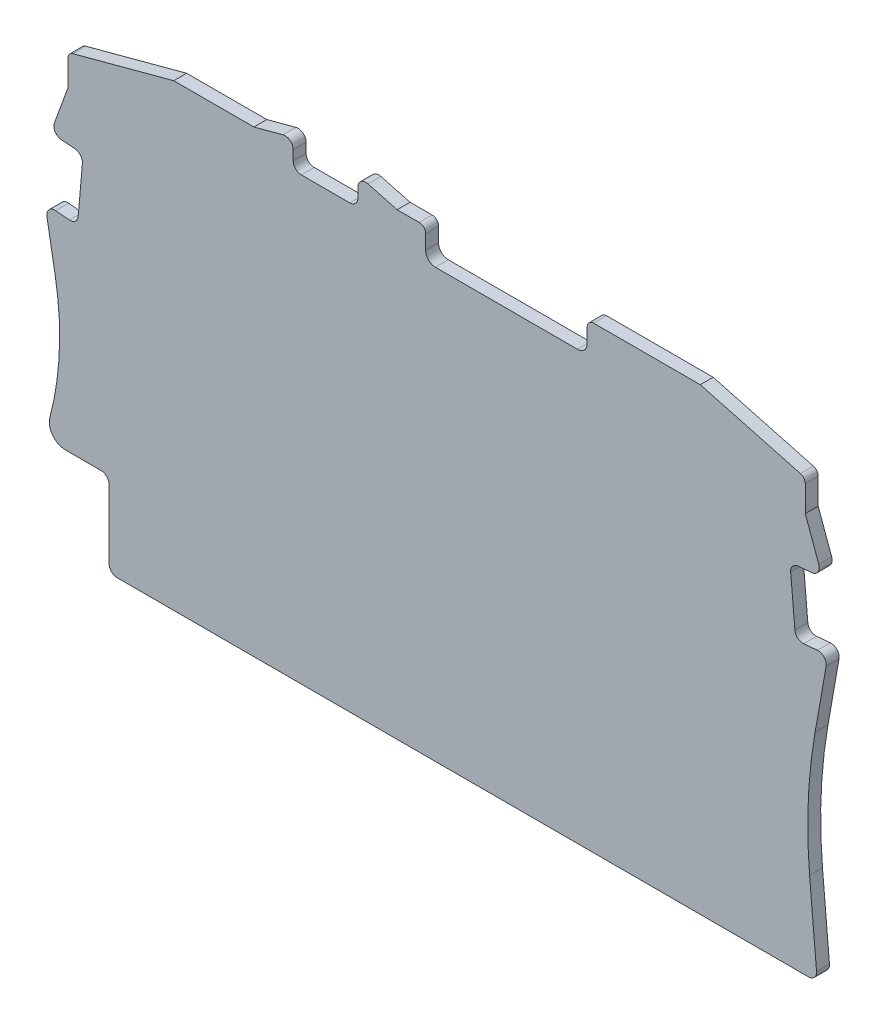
ISO-10303-21;
HEADER;
FILE_DESCRIPTION(('STEP AP214'),'2;1');
FILE_NAME('part.step','',(''),(''),'','','');
FILE_SCHEMA(('AUTOMOTIVE_DESIGN { 1 0 10303 214 1 1 1 1 }'));
ENDSEC;
DATA;
#1=APPLICATION_CONTEXT('core data for automotive mechanical design processes');
#2=APPLICATION_PROTOCOL_DEFINITION('international standard','automotive_design',2000,#1);
#3=PRODUCT_CONTEXT('',#1,'mechanical');
#4=PRODUCT('Part','Part','',(#3));
#5=PRODUCT_RELATED_PRODUCT_CATEGORY('part','',(#4));
#6=PRODUCT_DEFINITION_FORMATION('','',#4);
#7=PRODUCT_DEFINITION_CONTEXT('part definition',#1,'design');
#8=PRODUCT_DEFINITION('design','',#6,#7);
#9=PRODUCT_DEFINITION_SHAPE('','',#8);
#10=(LENGTH_UNIT() NAMED_UNIT(*) SI_UNIT(.MILLI.,.METRE.));
#11=(NAMED_UNIT(*) PLANE_ANGLE_UNIT() SI_UNIT($,.RADIAN.));
#12=(NAMED_UNIT(*) SI_UNIT($,.STERADIAN.) SOLID_ANGLE_UNIT());
#13=UNCERTAINTY_MEASURE_WITH_UNIT(LENGTH_MEASURE(1.E-05),#10,'distance_accuracy_value','');
#14=(GEOMETRIC_REPRESENTATION_CONTEXT(3) GLOBAL_UNCERTAINTY_ASSIGNED_CONTEXT((#13)) GLOBAL_UNIT_ASSIGNED_CONTEXT((#10,
#11,#12)) REPRESENTATION_CONTEXT('',''));
#15=CARTESIAN_POINT('',(0.,0.,0.));
#16=DIRECTION('',(0.,0.,1.));
#17=DIRECTION('',(1.,0.,0.));
#18=AXIS2_PLACEMENT_3D('',#15,#16,#17);
#19=CARTESIAN_POINT('',(-27.054694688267,18.50259810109,0.8));
#20=DIRECTION('',(-0.0871557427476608,-0.996194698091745,0.));
#21=DIRECTION('',(0.996194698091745,-0.0871557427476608,0.));
#22=AXIS2_PLACEMENT_3D('',#19,#20,#21);
#23=PLANE('',#22);
#24=DIRECTION('',(-0.996194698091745,0.0871557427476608,0.));
#25=VECTOR('',#24,1.);
#26=CARTESIAN_POINT('',(-27.054694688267,18.50259810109,0.));
#27=LINE('',#26,#25);
#28=CARTESIAN_POINT('',(-27.054694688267,18.50259810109,0.));
#29=VERTEX_POINT('',#28);
#30=CARTESIAN_POINT('',(-27.911422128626,18.577552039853,0.));
#31=VERTEX_POINT('',#30);
#32=EDGE_CURVE('E9',#29,#31,#27,.T.);
#33=ORIENTED_EDGE('',*,*,#32,.T.);
#34=DIRECTION('',(0.,0.,-1.));
#35=VECTOR('',#34,1.);
#36=CARTESIAN_POINT('',(-27.911422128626,18.577552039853,0.8));
#37=LINE('',#36,#35);
#38=CARTESIAN_POINT('',(-27.911422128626,18.577552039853,0.8));
#39=VERTEX_POINT('',#38);
#40=EDGE_CURVE('E23',#39,#31,#37,.T.);
#41=ORIENTED_EDGE('',*,*,#40,.F.);
#42=DIRECTION('',(-0.996194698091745,0.0871557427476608,0.));
#43=VECTOR('',#42,1.);
#44=CARTESIAN_POINT('',(-27.054694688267,18.50259810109,0.8));
#45=LINE('',#44,#43);
#46=CARTESIAN_POINT('',(-27.054694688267,18.50259810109,0.8));
#47=VERTEX_POINT('',#46);
#48=EDGE_CURVE('E1063',#47,#39,#45,.T.);
#49=ORIENTED_EDGE('',*,*,#48,.F.);
#50=DIRECTION('',(0.,0.,-1.));
#51=VECTOR('',#50,1.);
#52=CARTESIAN_POINT('',(-27.054694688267,18.50259810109,0.8));
#53=LINE('',#52,#51);
#54=EDGE_CURVE('E1059',#47,#29,#53,.T.);
#55=ORIENTED_EDGE('',*,*,#54,.T.);
#56=EDGE_LOOP('',(#33,#41,#49,#55));
#57=FACE_BOUND('',#56,.T.);
#58=ADVANCED_FACE('F15',(#57),#23,.F.);
#59=CARTESIAN_POINT('',(-27.0111168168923,19.000695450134,0.8));
#60=DIRECTION('',(0.,0.,-1.));
#61=DIRECTION('',(-0.642787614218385,0.766044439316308,0.));
#62=AXIS2_PLACEMENT_3D('',#59,#60,#61);
#63=CYLINDRICAL_SURFACE('',#62,0.499999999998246);
#64=CARTESIAN_POINT('',(-27.0111168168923,19.000695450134,0.));
#65=DIRECTION('',(0.,0.,1.));
#66=DIRECTION('',(1.,0.,0.));
#67=AXIS2_PLACEMENT_3D('',#64,#65,#66);
#68=CIRCLE('',#67,0.499999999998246);
#69=CARTESIAN_POINT('',(-26.513019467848,18.957117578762,0.));
#70=VERTEX_POINT('',#69);
#71=EDGE_CURVE('E1054',#29,#70,#68,.T.);
#72=ORIENTED_EDGE('',*,*,#71,.F.);
#73=ORIENTED_EDGE('',*,*,#54,.F.);
#74=CARTESIAN_POINT('',(-27.0111168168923,19.000695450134,0.8));
#75=DIRECTION('',(0.,0.,1.));
#76=DIRECTION('',(1.,0.,0.));
#77=AXIS2_PLACEMENT_3D('',#74,#75,#76);
#78=CIRCLE('',#77,0.499999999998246);
#79=CARTESIAN_POINT('',(-26.513019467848,18.957117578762,0.8));
#80=VERTEX_POINT('',#79);
#81=EDGE_CURVE('E1050',#47,#80,#78,.T.);
#82=ORIENTED_EDGE('',*,*,#81,.T.);
#83=DIRECTION('',(0.,0.,-1.));
#84=VECTOR('',#83,1.);
#85=CARTESIAN_POINT('',(-26.513019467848,18.957117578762,0.8));
#86=LINE('',#85,#84);
#87=EDGE_CURVE('E1046',#80,#70,#86,.T.);
#88=ORIENTED_EDGE('',*,*,#87,.T.);
#89=EDGE_LOOP('',(#72,#73,#82,#88));
#90=FACE_BOUND('',#89,.T.);
#91=ADVANCED_FACE('F1078',(#90),#63,.F.);
#92=CARTESIAN_POINT('',(-26.251552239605,21.945701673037,0.8));
#93=DIRECTION('',(0.996194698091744,-0.0871557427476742,0.));
#94=DIRECTION('',(0.0871557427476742,0.996194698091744,0.));
#95=AXIS2_PLACEMENT_3D('',#92,#93,#94);
#96=PLANE('',#95);
#97=DIRECTION('',(-0.0871557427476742,-0.996194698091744,0.));
#98=VECTOR('',#97,1.);
#99=CARTESIAN_POINT('',(-26.251552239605,21.945701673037,0.));
#100=LINE('',#99,#98);
#101=CARTESIAN_POINT('',(-26.251552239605,21.945701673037,0.));
#102=VERTEX_POINT('',#101);
#103=EDGE_CURVE('E1041',#102,#70,#100,.T.);
#104=ORIENTED_EDGE('',*,*,#103,.T.);
#105=ORIENTED_EDGE('',*,*,#87,.F.);
#106=DIRECTION('',(-0.0871557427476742,-0.996194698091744,0.));
#107=VECTOR('',#106,1.);
#108=CARTESIAN_POINT('',(-26.251552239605,21.945701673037,0.8));
#109=LINE('',#108,#107);
#110=CARTESIAN_POINT('',(-26.251552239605,21.945701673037,0.8));
#111=VERTEX_POINT('',#110);
#112=EDGE_CURVE('E1036',#111,#80,#109,.T.);
#113=ORIENTED_EDGE('',*,*,#112,.F.);
#114=DIRECTION('',(0.,0.,-1.));
#115=VECTOR('',#114,1.);
#116=CARTESIAN_POINT('',(-26.251552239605,21.945701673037,0.8));
#117=LINE('',#116,#115);
#118=EDGE_CURVE('E1032',#111,#102,#117,.T.);
#119=ORIENTED_EDGE('',*,*,#118,.T.);
#120=EDGE_LOOP('',(#104,#105,#113,#119));
#121=FACE_BOUND('',#120,.T.);
#122=ADVANCED_FACE('F1084',(#121),#96,.F.);
#123=CARTESIAN_POINT('',(-26.7496495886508,21.9892795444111,0.8));
#124=DIRECTION('',(0.,0.,-1.));
#125=DIRECTION('',(-0.766044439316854,-0.642787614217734,0.));
#126=AXIS2_PLACEMENT_3D('',#123,#124,#125);
#127=CYLINDRICAL_SURFACE('',#126,0.499999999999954);
#128=CARTESIAN_POINT('',(-26.7496495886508,21.9892795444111,0.));
#129=DIRECTION('',(0.,0.,1.));
#130=DIRECTION('',(1.,0.,0.));
#131=AXIS2_PLACEMENT_3D('',#128,#129,#130);
#132=CIRCLE('',#131,0.499999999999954);
#133=CARTESIAN_POINT('',(-26.706071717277,22.487376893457,0.));
#134=VERTEX_POINT('',#133);
#135=EDGE_CURVE('E1027',#102,#134,#132,.T.);
#136=ORIENTED_EDGE('',*,*,#135,.F.);
#137=ORIENTED_EDGE('',*,*,#118,.F.);
#138=CARTESIAN_POINT('',(-26.7496495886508,21.9892795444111,0.8));
#139=DIRECTION('',(0.,0.,1.));
#140=DIRECTION('',(1.,0.,0.));
#141=AXIS2_PLACEMENT_3D('',#138,#139,#140);
#142=CIRCLE('',#141,0.499999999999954);
#143=CARTESIAN_POINT('',(-26.706071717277,22.487376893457,0.8));
#144=VERTEX_POINT('',#143);
#145=EDGE_CURVE('E1023',#111,#144,#142,.T.);
#146=ORIENTED_EDGE('',*,*,#145,.T.);
#147=DIRECTION('',(0.,0.,-1.));
#148=VECTOR('',#147,1.);
#149=CARTESIAN_POINT('',(-26.706071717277,22.487376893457,0.8));
#150=LINE('',#149,#148);
#151=EDGE_CURVE('E1019',#144,#134,#150,.T.);
#152=ORIENTED_EDGE('',*,*,#151,.T.);
#153=EDGE_LOOP('',(#136,#137,#146,#152));
#154=FACE_BOUND('',#153,.T.);
#155=ADVANCED_FACE('F1088',(#154),#127,.F.);
#156=CARTESIAN_POINT('',(-27.562799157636,22.56233083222,0.8));
#157=DIRECTION('',(0.0871557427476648,0.996194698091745,0.));
#158=DIRECTION('',(-0.996194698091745,0.0871557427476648,0.));
#159=AXIS2_PLACEMENT_3D('',#156,#157,#158);
#160=PLANE('',#159);
#161=DIRECTION('',(0.996194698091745,-0.0871557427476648,0.));
#162=VECTOR('',#161,1.);
#163=CARTESIAN_POINT('',(-27.562799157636,22.56233083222,0.));
#164=LINE('',#163,#162);
#165=CARTESIAN_POINT('',(-27.562799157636,22.56233083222,0.));
#166=VERTEX_POINT('',#165);
#167=EDGE_CURVE('E1014',#166,#134,#164,.T.);
#168=ORIENTED_EDGE('',*,*,#167,.T.);
#169=ORIENTED_EDGE('',*,*,#151,.F.);
#170=DIRECTION('',(0.996194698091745,-0.0871557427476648,0.));
#171=VECTOR('',#170,1.);
#172=CARTESIAN_POINT('',(-27.562799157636,22.56233083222,0.8));
#173=LINE('',#172,#171);
#174=CARTESIAN_POINT('',(-27.562799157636,22.56233083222,0.8));
#175=VERTEX_POINT('',#174);
#176=EDGE_CURVE('E1009',#175,#144,#173,.T.);
#177=ORIENTED_EDGE('',*,*,#176,.F.);
#178=DIRECTION('',(0.,0.,-1.));
#179=VECTOR('',#178,1.);
#180=CARTESIAN_POINT('',(-27.562799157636,22.56233083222,0.8));
#181=LINE('',#180,#179);
#182=EDGE_CURVE('E1005',#175,#166,#181,.T.);
#183=ORIENTED_EDGE('',*,*,#182,.T.);
#184=EDGE_LOOP('',(#168,#169,#177,#183));
#185=FACE_BOUND('',#184,.T.);
#186=ADVANCED_FACE('F1091',(#185),#160,.F.);
#187=CARTESIAN_POINT('',(-27.5192212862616,23.0604281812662,0.8));
#188=DIRECTION('',(0.,0.,-1.));
#189=DIRECTION('',(0.843391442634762,0.537299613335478,0.));
#190=AXIS2_PLACEMENT_3D('',#187,#188,#189);
#191=CYLINDRICAL_SURFACE('',#190,0.500000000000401);
#192=CARTESIAN_POINT('',(-27.5192212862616,23.0604281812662,0.));
#193=DIRECTION('',(0.,0.,1.));
#194=DIRECTION('',(1.,0.,0.));
#195=AXIS2_PLACEMENT_3D('',#192,#193,#194);
#196=CIRCLE('',#195,0.500000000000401);
#197=CARTESIAN_POINT('',(-27.989067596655,23.231438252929,0.));
#198=VERTEX_POINT('',#197);
#199=EDGE_CURVE('E1000',#198,#166,#196,.T.);
#200=ORIENTED_EDGE('',*,*,#199,.T.);
#201=ORIENTED_EDGE('',*,*,#182,.F.);
#202=CARTESIAN_POINT('',(-27.5192212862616,23.0604281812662,0.8));
#203=DIRECTION('',(0.,0.,1.));
#204=DIRECTION('',(1.,0.,0.));
#205=AXIS2_PLACEMENT_3D('',#202,#203,#204);
#206=CIRCLE('',#205,0.500000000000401);
#207=CARTESIAN_POINT('',(-27.989067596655,23.231438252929,0.8));
#208=VERTEX_POINT('',#207);
#209=EDGE_CURVE('E995',#208,#175,#206,.T.);
#210=ORIENTED_EDGE('',*,*,#209,.F.);
#211=DIRECTION('',(0.,0.,-1.));
#212=VECTOR('',#211,1.);
#213=CARTESIAN_POINT('',(-27.989067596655,23.231438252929,0.8));
#214=LINE('',#213,#212);
#215=EDGE_CURVE('E991',#208,#198,#214,.T.);
#216=ORIENTED_EDGE('',*,*,#215,.T.);
#217=EDGE_LOOP('',(#200,#201,#210,#216));
#218=FACE_BOUND('',#217,.T.);
#219=ADVANCED_FACE('F1097',(#218),#191,.T.);
#220=CARTESIAN_POINT('',(-27.15,25.536757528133,0.8));
#221=DIRECTION('',(0.939692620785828,-0.342020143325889,0.));
#222=DIRECTION('',(0.342020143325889,0.939692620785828,0.));
#223=AXIS2_PLACEMENT_3D('',#220,#221,#222);
#224=PLANE('',#223);
#225=DIRECTION('',(-0.342020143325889,-0.939692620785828,0.));
#226=VECTOR('',#225,1.);
#227=CARTESIAN_POINT('',(-27.15,25.536757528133,0.));
#228=LINE('',#227,#226);
#229=CARTESIAN_POINT('',(-27.15,25.536757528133,0.));
#230=VERTEX_POINT('',#229);
#231=EDGE_CURVE('E986',#230,#198,#228,.T.);
#232=ORIENTED_EDGE('',*,*,#231,.T.);
#233=ORIENTED_EDGE('',*,*,#215,.F.);
#234=DIRECTION('',(-0.342020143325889,-0.939692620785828,0.));
#235=VECTOR('',#234,1.);
#236=CARTESIAN_POINT('',(-27.15,25.536757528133,0.8));
#237=LINE('',#236,#235);
#238=CARTESIAN_POINT('',(-27.15,25.536757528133,0.8));
#239=VERTEX_POINT('',#238);
#240=EDGE_CURVE('E981',#239,#208,#237,.T.);
#241=ORIENTED_EDGE('',*,*,#240,.F.);
#242=DIRECTION('',(0.,0.,-1.));
#243=VECTOR('',#242,1.);
#244=CARTESIAN_POINT('',(-27.15,25.536757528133,0.8));
#245=LINE('',#244,#243);
#246=EDGE_CURVE('E977',#239,#230,#245,.T.);
#247=ORIENTED_EDGE('',*,*,#246,.T.);
#248=EDGE_LOOP('',(#232,#233,#241,#247));
#249=FACE_BOUND('',#248,.T.);
#250=ADVANCED_FACE('F1100',(#249),#224,.F.);
#251=CARTESIAN_POINT('',(-27.15,27.138001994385,0.8));
#252=DIRECTION('',(1.,0.,0.));
#253=DIRECTION('',(0.,0.,-1.));
#254=AXIS2_PLACEMENT_3D('',#251,#252,#253);
#255=PLANE('',#254);
#256=DIRECTION('',(0.,-1.,0.));
#257=VECTOR('',#256,1.);
#258=CARTESIAN_POINT('',(-27.15,27.138001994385,0.));
#259=LINE('',#258,#257);
#260=CARTESIAN_POINT('',(-27.15,27.138001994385,0.));
#261=VERTEX_POINT('',#260);
#262=EDGE_CURVE('E972',#261,#230,#259,.T.);
#263=ORIENTED_EDGE('',*,*,#262,.T.);
#264=ORIENTED_EDGE('',*,*,#246,.F.);
#265=DIRECTION('',(0.,-1.,0.));
#266=VECTOR('',#265,1.);
#267=CARTESIAN_POINT('',(-27.15,27.138001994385,0.8));
#268=LINE('',#267,#266);
#269=CARTESIAN_POINT('',(-27.15,27.138001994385,0.8));
#270=VERTEX_POINT('',#269);
#271=EDGE_CURVE('E967',#270,#239,#268,.T.);
#272=ORIENTED_EDGE('',*,*,#271,.F.);
#273=DIRECTION('',(0.,0.,-1.));
#274=VECTOR('',#273,1.);
#275=CARTESIAN_POINT('',(-27.15,27.138001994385,0.8));
#276=LINE('',#275,#274);
#277=EDGE_CURVE('E963',#270,#261,#276,.T.);
#278=ORIENTED_EDGE('',*,*,#277,.T.);
#279=EDGE_LOOP('',(#263,#264,#272,#278));
#280=FACE_BOUND('',#279,.T.);
#281=ADVANCED_FACE('F1103',(#280),#255,.F.);
#282=CARTESIAN_POINT('',(-26.7499999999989,27.1380019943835,0.8));
#283=DIRECTION('',(0.,0.,-1.));
#284=DIRECTION('',(0.793353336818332,-0.608761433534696,0.));
#285=AXIS2_PLACEMENT_3D('',#282,#283,#284);
#286=CYLINDRICAL_SURFACE('',#285,0.400000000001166);
#287=CARTESIAN_POINT('',(-26.7499999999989,27.1380019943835,0.));
#288=DIRECTION('',(0.,0.,1.));
#289=DIRECTION('',(1.,0.,0.));
#290=AXIS2_PLACEMENT_3D('',#287,#288,#289);
#291=CIRCLE('',#290,0.400000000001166);
#292=CARTESIAN_POINT('',(-26.853527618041,27.5243723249,0.));
#293=VERTEX_POINT('',#292);
#294=EDGE_CURVE('E958',#293,#261,#291,.T.);
#295=ORIENTED_EDGE('',*,*,#294,.T.);
#296=ORIENTED_EDGE('',*,*,#277,.F.);
#297=CARTESIAN_POINT('',(-26.7499999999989,27.1380019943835,0.8));
#298=DIRECTION('',(0.,0.,1.));
#299=DIRECTION('',(1.,0.,0.));
#300=AXIS2_PLACEMENT_3D('',#297,#298,#299);
#301=CIRCLE('',#300,0.400000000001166);
#302=CARTESIAN_POINT('',(-26.853527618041,27.5243723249,0.8));
#303=VERTEX_POINT('',#302);
#304=EDGE_CURVE('E953',#303,#270,#301,.T.);
#305=ORIENTED_EDGE('',*,*,#304,.F.);
#306=DIRECTION('',(0.,0.,-1.));
#307=VECTOR('',#306,1.);
#308=CARTESIAN_POINT('',(-26.853527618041,27.5243723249,0.8));
#309=LINE('',#308,#307);
#310=EDGE_CURVE('E949',#303,#293,#309,.T.);
#311=ORIENTED_EDGE('',*,*,#310,.T.);
#312=EDGE_LOOP('',(#295,#296,#305,#311));
#313=FACE_BOUND('',#312,.T.);
#314=ADVANCED_FACE('F1109',(#313),#286,.T.);
#315=CARTESIAN_POINT('',(-20.6,29.2,0.8));
#316=DIRECTION('',(0.258819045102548,-0.965925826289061,0.));
#317=DIRECTION('',(0.965925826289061,0.258819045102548,0.));
#318=AXIS2_PLACEMENT_3D('',#315,#316,#317);
#319=PLANE('',#318);
#320=DIRECTION('',(-0.965925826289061,-0.258819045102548,0.));
#321=VECTOR('',#320,1.);
#322=CARTESIAN_POINT('',(-20.6,29.2,0.));
#323=LINE('',#322,#321);
#324=CARTESIAN_POINT('',(-20.6,29.2,0.));
#325=VERTEX_POINT('',#324);
#326=EDGE_CURVE('E944',#325,#293,#323,.T.);
#327=ORIENTED_EDGE('',*,*,#326,.T.);
#328=ORIENTED_EDGE('',*,*,#310,.F.);
#329=DIRECTION('',(-0.965925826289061,-0.258819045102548,0.));
#330=VECTOR('',#329,1.);
#331=CARTESIAN_POINT('',(-20.6,29.2,0.8));
#332=LINE('',#331,#330);
#333=CARTESIAN_POINT('',(-20.6,29.2,0.8));
#334=VERTEX_POINT('',#333);
#335=EDGE_CURVE('E939',#334,#303,#332,.T.);
#336=ORIENTED_EDGE('',*,*,#335,.F.);
#337=DIRECTION('',(0.,0.,-1.));
#338=VECTOR('',#337,1.);
#339=CARTESIAN_POINT('',(-20.6,29.2,0.8));
#340=LINE('',#339,#338);
#341=EDGE_CURVE('E935',#334,#325,#340,.T.);
#342=ORIENTED_EDGE('',*,*,#341,.T.);
#343=EDGE_LOOP('',(#327,#328,#336,#342));
#344=FACE_BOUND('',#343,.T.);
#345=ADVANCED_FACE('F1112',(#344),#319,.F.);
#346=CARTESIAN_POINT('',(-15.631851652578,29.2,0.8));
#347=DIRECTION('',(0.,-1.,0.));
#348=DIRECTION('',(0.,0.,-1.));
#349=AXIS2_PLACEMENT_3D('',#346,#347,#348);
#350=PLANE('',#349);
#351=DIRECTION('',(-1.,0.,0.));
#352=VECTOR('',#351,1.);
#353=CARTESIAN_POINT('',(-15.631851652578,29.2,0.));
#354=LINE('',#353,#352);
#355=CARTESIAN_POINT('',(-15.631851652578,29.2,0.));
#356=VERTEX_POINT('',#355);
#357=EDGE_CURVE('E930',#356,#325,#354,.T.);
#358=ORIENTED_EDGE('',*,*,#357,.T.);
#359=ORIENTED_EDGE('',*,*,#341,.F.);
#360=DIRECTION('',(-1.,0.,0.));
#361=VECTOR('',#360,1.);
#362=CARTESIAN_POINT('',(-15.631851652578,29.2,0.8));
#363=LINE('',#362,#361);
#364=CARTESIAN_POINT('',(-15.631851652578,29.2,0.8));
#365=VERTEX_POINT('',#364);
#366=EDGE_CURVE('E925',#365,#334,#363,.T.);
#367=ORIENTED_EDGE('',*,*,#366,.F.);
#368=DIRECTION('',(0.,0.,-1.));
#369=VECTOR('',#368,1.);
#370=CARTESIAN_POINT('',(-15.631851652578,29.2,0.8));
#371=LINE('',#370,#369);
#372=EDGE_CURVE('E921',#365,#356,#371,.T.);
#373=ORIENTED_EDGE('',*,*,#372,.T.);
#374=EDGE_LOOP('',(#358,#359,#367,#373));
#375=FACE_BOUND('',#374,.T.);
#376=ADVANCED_FACE('F1115',(#375),#350,.F.);
#377=CARTESIAN_POINT('',(-13.829409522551,29.682962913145,0.8));
#378=DIRECTION('',(0.258819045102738,-0.96592582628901,0.));
#379=DIRECTION('',(0.96592582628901,0.258819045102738,0.));
#380=AXIS2_PLACEMENT_3D('',#377,#378,#379);
#381=PLANE('',#380);
#382=DIRECTION('',(-0.96592582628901,-0.258819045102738,0.));
#383=VECTOR('',#382,1.);
#384=CARTESIAN_POINT('',(-13.829409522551,29.682962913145,0.));
#385=LINE('',#384,#383);
#386=CARTESIAN_POINT('',(-13.829409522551,29.682962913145,0.));
#387=VERTEX_POINT('',#386);
#388=EDGE_CURVE('E916',#387,#356,#385,.T.);
#389=ORIENTED_EDGE('',*,*,#388,.T.);
#390=ORIENTED_EDGE('',*,*,#372,.F.);
#391=DIRECTION('',(-0.96592582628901,-0.258819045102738,0.));
#392=VECTOR('',#391,1.);
#393=CARTESIAN_POINT('',(-13.829409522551,29.682962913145,0.8));
#394=LINE('',#393,#392);
#395=CARTESIAN_POINT('',(-13.829409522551,29.682962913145,0.8));
#396=VERTEX_POINT('',#395);
#397=EDGE_CURVE('E911',#396,#365,#394,.T.);
#398=ORIENTED_EDGE('',*,*,#397,.F.);
#399=DIRECTION('',(0.,0.,-1.));
#400=VECTOR('',#399,1.);
#401=CARTESIAN_POINT('',(-13.829409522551,29.682962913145,0.8));
#402=LINE('',#401,#400);
#403=EDGE_CURVE('E907',#396,#387,#402,.T.);
#404=ORIENTED_EDGE('',*,*,#403,.T.);
#405=EDGE_LOOP('',(#389,#390,#398,#404));
#406=FACE_BOUND('',#405,.T.);
#407=ADVANCED_FACE('F1121',(#406),#381,.F.);
#408=CARTESIAN_POINT('',(-13.7000000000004,29.2,0.8));
#409=DIRECTION('',(0.,0.,-1.));
#410=DIRECTION('',(-0.608761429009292,-0.793353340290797,0.));
#411=AXIS2_PLACEMENT_3D('',#408,#409,#410);
#412=CYLINDRICAL_SURFACE('',#411,0.500000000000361);
#413=CARTESIAN_POINT('',(-13.7000000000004,29.2,0.));
#414=DIRECTION('',(0.,0.,1.));
#415=DIRECTION('',(1.,0.,0.));
#416=AXIS2_PLACEMENT_3D('',#413,#414,#415);
#417=CIRCLE('',#416,0.500000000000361);
#418=CARTESIAN_POINT('',(-13.2,29.2,0.));
#419=VERTEX_POINT('',#418);
#420=EDGE_CURVE('E902',#419,#387,#417,.T.);
#421=ORIENTED_EDGE('',*,*,#420,.T.);
#422=ORIENTED_EDGE('',*,*,#403,.F.);
#423=CARTESIAN_POINT('',(-13.7000000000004,29.2,0.8));
#424=DIRECTION('',(0.,0.,1.));
#425=DIRECTION('',(1.,0.,0.));
#426=AXIS2_PLACEMENT_3D('',#423,#424,#425);
#427=CIRCLE('',#426,0.500000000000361);
#428=CARTESIAN_POINT('',(-13.2,29.2,0.8));
#429=VERTEX_POINT('',#428);
#430=EDGE_CURVE('E897',#429,#396,#427,.T.);
#431=ORIENTED_EDGE('',*,*,#430,.F.);
#432=DIRECTION('',(0.,0.,-1.));
#433=VECTOR('',#432,1.);
#434=CARTESIAN_POINT('',(-13.2,29.2,0.8));
#435=LINE('',#434,#433);
#436=EDGE_CURVE('E893',#429,#419,#435,.T.);
#437=ORIENTED_EDGE('',*,*,#436,.T.);
#438=EDGE_LOOP('',(#421,#422,#431,#437));
#439=FACE_BOUND('',#438,.T.);
#440=ADVANCED_FACE('F1124',(#439),#412,.T.);
#441=CARTESIAN_POINT('',(-13.2,28.6,0.8));
#442=DIRECTION('',(-1.,0.,0.));
#443=DIRECTION('',(0.,0.,1.));
#444=AXIS2_PLACEMENT_3D('',#441,#442,#443);
#445=PLANE('',#444);
#446=DIRECTION('',(0.,1.,0.));
#447=VECTOR('',#446,1.);
#448=CARTESIAN_POINT('',(-13.2,28.6,0.));
#449=LINE('',#448,#447);
#450=CARTESIAN_POINT('',(-13.2,28.6,0.));
#451=VERTEX_POINT('',#450);
#452=EDGE_CURVE('E888',#451,#419,#449,.T.);
#453=ORIENTED_EDGE('',*,*,#452,.T.);
#454=ORIENTED_EDGE('',*,*,#436,.F.);
#455=DIRECTION('',(0.,1.,0.));
#456=VECTOR('',#455,1.);
#457=CARTESIAN_POINT('',(-13.2,28.6,0.8));
#458=LINE('',#457,#456);
#459=CARTESIAN_POINT('',(-13.2,28.6,0.8));
#460=VERTEX_POINT('',#459);
#461=EDGE_CURVE('E883',#460,#429,#458,.T.);
#462=ORIENTED_EDGE('',*,*,#461,.F.);
#463=DIRECTION('',(0.,0.,-1.));
#464=VECTOR('',#463,1.);
#465=CARTESIAN_POINT('',(-13.2,28.6,0.8));
#466=LINE('',#465,#464);
#467=EDGE_CURVE('E879',#460,#451,#466,.T.);
#468=ORIENTED_EDGE('',*,*,#467,.T.);
#469=EDGE_LOOP('',(#453,#454,#462,#468));
#470=FACE_BOUND('',#469,.T.);
#471=ADVANCED_FACE('F1127',(#470),#445,.F.);
#472=CARTESIAN_POINT('',(-12.6999999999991,28.6000000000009,0.8));
#473=DIRECTION('',(0.,0.,-1.));
#474=DIRECTION('',(0.707106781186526,0.707106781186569,0.));
#475=AXIS2_PLACEMENT_3D('',#472,#473,#474);
#476=CYLINDRICAL_SURFACE('',#475,0.500000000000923);
#477=CARTESIAN_POINT('',(-12.6999999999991,28.6000000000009,0.));
#478=DIRECTION('',(0.,0.,1.));
#479=DIRECTION('',(1.,0.,0.));
#480=AXIS2_PLACEMENT_3D('',#477,#478,#479);
#481=CIRCLE('',#480,0.500000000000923);
#482=CARTESIAN_POINT('',(-12.7,28.1,0.));
#483=VERTEX_POINT('',#482);
#484=EDGE_CURVE('E874',#451,#483,#481,.T.);
#485=ORIENTED_EDGE('',*,*,#484,.F.);
#486=ORIENTED_EDGE('',*,*,#467,.F.);
#487=CARTESIAN_POINT('',(-12.6999999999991,28.6000000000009,0.8));
#488=DIRECTION('',(0.,0.,1.));
#489=DIRECTION('',(1.,0.,0.));
#490=AXIS2_PLACEMENT_3D('',#487,#488,#489);
#491=CIRCLE('',#490,0.500000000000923);
#492=CARTESIAN_POINT('',(-12.7,28.1,0.8));
#493=VERTEX_POINT('',#492);
#494=EDGE_CURVE('E870',#460,#493,#491,.T.);
#495=ORIENTED_EDGE('',*,*,#494,.T.);
#496=DIRECTION('',(0.,0.,-1.));
#497=VECTOR('',#496,1.);
#498=CARTESIAN_POINT('',(-12.7,28.1,0.8));
#499=LINE('',#498,#497);
#500=EDGE_CURVE('E866',#493,#483,#499,.T.);
#501=ORIENTED_EDGE('',*,*,#500,.T.);
#502=EDGE_LOOP('',(#485,#486,#495,#501));
#503=FACE_BOUND('',#502,.T.);
#504=ADVANCED_FACE('F1132',(#503),#476,.F.);
#505=CARTESIAN_POINT('',(-9.7,28.1,0.8));
#506=DIRECTION('',(0.,-1.,0.));
#507=DIRECTION('',(0.,0.,-1.));
#508=AXIS2_PLACEMENT_3D('',#505,#506,#507);
#509=PLANE('',#508);
#510=DIRECTION('',(-1.,0.,0.));
#511=VECTOR('',#510,1.);
#512=CARTESIAN_POINT('',(-9.7,28.1,0.));
#513=LINE('',#512,#511);
#514=CARTESIAN_POINT('',(-9.7,28.1,0.));
#515=VERTEX_POINT('',#514);
#516=EDGE_CURVE('E861',#515,#483,#513,.T.);
#517=ORIENTED_EDGE('',*,*,#516,.T.);
#518=ORIENTED_EDGE('',*,*,#500,.F.);
#519=DIRECTION('',(-1.,0.,0.));
#520=VECTOR('',#519,1.);
#521=CARTESIAN_POINT('',(-9.7,28.1,0.8));
#522=LINE('',#521,#520);
#523=CARTESIAN_POINT('',(-9.7,28.1,0.8));
#524=VERTEX_POINT('',#523);
#525=EDGE_CURVE('E856',#524,#493,#522,.T.);
#526=ORIENTED_EDGE('',*,*,#525,.F.);
#527=DIRECTION('',(0.,0.,-1.));
#528=VECTOR('',#527,1.);
#529=CARTESIAN_POINT('',(-9.7,28.1,0.8));
#530=LINE('',#529,#528);
#531=EDGE_CURVE('E852',#524,#515,#530,.T.);
#532=ORIENTED_EDGE('',*,*,#531,.T.);
#533=EDGE_LOOP('',(#517,#518,#526,#532));
#534=FACE_BOUND('',#533,.T.);
#535=ADVANCED_FACE('F1136',(#534),#509,.F.);
#536=CARTESIAN_POINT('',(-9.70000000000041,28.6000000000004,0.8));
#537=DIRECTION('',(0.,0.,-1.));
#538=DIRECTION('',(-0.707106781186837,0.707106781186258,0.));
#539=AXIS2_PLACEMENT_3D('',#536,#537,#538);
#540=CYLINDRICAL_SURFACE('',#539,0.500000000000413);
#541=CARTESIAN_POINT('',(-9.70000000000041,28.6000000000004,0.));
#542=DIRECTION('',(0.,0.,1.));
#543=DIRECTION('',(1.,0.,0.));
#544=AXIS2_PLACEMENT_3D('',#541,#542,#543);
#545=CIRCLE('',#544,0.500000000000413);
#546=CARTESIAN_POINT('',(-9.2,28.6,0.));
#547=VERTEX_POINT('',#546);
#548=EDGE_CURVE('E847',#515,#547,#545,.T.);
#549=ORIENTED_EDGE('',*,*,#548,.F.);
#550=ORIENTED_EDGE('',*,*,#531,.F.);
#551=CARTESIAN_POINT('',(-9.70000000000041,28.6000000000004,0.8));
#552=DIRECTION('',(0.,0.,1.));
#553=DIRECTION('',(1.,0.,0.));
#554=AXIS2_PLACEMENT_3D('',#551,#552,#553);
#555=CIRCLE('',#554,0.500000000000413);
#556=CARTESIAN_POINT('',(-9.2,28.6,0.8));
#557=VERTEX_POINT('',#556);
#558=EDGE_CURVE('E843',#524,#557,#555,.T.);
#559=ORIENTED_EDGE('',*,*,#558,.T.);
#560=DIRECTION('',(0.,0.,-1.));
#561=VECTOR('',#560,1.);
#562=CARTESIAN_POINT('',(-9.2,28.6,0.8));
#563=LINE('',#562,#561);
#564=EDGE_CURVE('E839',#557,#547,#563,.T.);
#565=ORIENTED_EDGE('',*,*,#564,.T.);
#566=EDGE_LOOP('',(#549,#550,#559,#565));
#567=FACE_BOUND('',#566,.T.);
#568=ADVANCED_FACE('F1141',(#567),#540,.F.);
#569=CARTESIAN_POINT('',(-9.2,29.2,0.8));
#570=DIRECTION('',(1.,0.,0.));
#571=DIRECTION('',(0.,0.,-1.));
#572=AXIS2_PLACEMENT_3D('',#569,#570,#571);
#573=PLANE('',#572);
#574=DIRECTION('',(0.,-1.,0.));
#575=VECTOR('',#574,1.);
#576=CARTESIAN_POINT('',(-9.2,29.2,0.));
#577=LINE('',#576,#575);
#578=CARTESIAN_POINT('',(-9.2,29.2,0.));
#579=VERTEX_POINT('',#578);
#580=EDGE_CURVE('E834',#579,#547,#577,.T.);
#581=ORIENTED_EDGE('',*,*,#580,.T.);
#582=ORIENTED_EDGE('',*,*,#564,.F.);
#583=DIRECTION('',(0.,-1.,0.));
#584=VECTOR('',#583,1.);
#585=CARTESIAN_POINT('',(-9.2,29.2,0.8));
#586=LINE('',#585,#584);
#587=CARTESIAN_POINT('',(-9.2,29.2,0.8));
#588=VERTEX_POINT('',#587);
#589=EDGE_CURVE('E829',#588,#557,#586,.T.);
#590=ORIENTED_EDGE('',*,*,#589,.F.);
#591=DIRECTION('',(0.,0.,-1.));
#592=VECTOR('',#591,1.);
#593=CARTESIAN_POINT('',(-9.2,29.2,0.8));
#594=LINE('',#593,#592);
#595=EDGE_CURVE('E825',#588,#579,#594,.T.);
#596=ORIENTED_EDGE('',*,*,#595,.T.);
#597=EDGE_LOOP('',(#581,#582,#590,#596));
#598=FACE_BOUND('',#597,.T.);
#599=ADVANCED_FACE('F1147',(#598),#573,.F.);
#600=CARTESIAN_POINT('',(-8.7,29.2000000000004,0.8));
#601=DIRECTION('',(0.,0.,-1.));
#602=DIRECTION('',(0.608761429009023,-0.793353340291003,0.));
#603=AXIS2_PLACEMENT_3D('',#600,#601,#602);
#604=CYLINDRICAL_SURFACE('',#603,0.500000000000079);
#605=CARTESIAN_POINT('',(-8.7,29.2000000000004,0.));
#606=DIRECTION('',(0.,0.,1.));
#607=DIRECTION('',(1.,0.,0.));
#608=AXIS2_PLACEMENT_3D('',#605,#606,#607);
#609=CIRCLE('',#608,0.500000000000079);
#610=CARTESIAN_POINT('',(-8.5705904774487,29.682962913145,0.));
#611=VERTEX_POINT('',#610);
#612=EDGE_CURVE('E820',#611,#579,#609,.T.);
#613=ORIENTED_EDGE('',*,*,#612,.T.);
#614=ORIENTED_EDGE('',*,*,#595,.F.);
#615=CARTESIAN_POINT('',(-8.7,29.2000000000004,0.8));
#616=DIRECTION('',(0.,0.,1.));
#617=DIRECTION('',(1.,0.,0.));
#618=AXIS2_PLACEMENT_3D('',#615,#616,#617);
#619=CIRCLE('',#618,0.500000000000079);
#620=CARTESIAN_POINT('',(-8.5705904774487,29.682962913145,0.8));
#621=VERTEX_POINT('',#620);
#622=EDGE_CURVE('E815',#621,#588,#619,.T.);
#623=ORIENTED_EDGE('',*,*,#622,.F.);
#624=DIRECTION('',(0.,0.,-1.));
#625=VECTOR('',#624,1.);
#626=CARTESIAN_POINT('',(-8.5705904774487,29.682962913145,0.8));
#627=LINE('',#626,#625);
#628=EDGE_CURVE('E811',#621,#611,#627,.T.);
#629=ORIENTED_EDGE('',*,*,#628,.T.);
#630=EDGE_LOOP('',(#613,#614,#623,#629));
#631=FACE_BOUND('',#630,.T.);
#632=ADVANCED_FACE('F1150',(#631),#604,.T.);
#633=CARTESIAN_POINT('',(-6.7681483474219,29.2,0.8));
#634=DIRECTION('',(-0.258819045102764,-0.965925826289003,0.));
#635=DIRECTION('',(0.965925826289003,-0.258819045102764,0.));
#636=AXIS2_PLACEMENT_3D('',#633,#634,#635);
#637=PLANE('',#636);
#638=DIRECTION('',(-0.965925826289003,0.258819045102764,0.));
#639=VECTOR('',#638,1.);
#640=CARTESIAN_POINT('',(-6.7681483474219,29.2,0.));
#641=LINE('',#640,#639);
#642=CARTESIAN_POINT('',(-6.7681483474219,29.2,0.));
#643=VERTEX_POINT('',#642);
#644=EDGE_CURVE('E806',#643,#611,#641,.T.);
#645=ORIENTED_EDGE('',*,*,#644,.T.);
#646=ORIENTED_EDGE('',*,*,#628,.F.);
#647=DIRECTION('',(-0.965925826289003,0.258819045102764,0.));
#648=VECTOR('',#647,1.);
#649=CARTESIAN_POINT('',(-6.7681483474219,29.2,0.8));
#650=LINE('',#649,#648);
#651=CARTESIAN_POINT('',(-6.7681483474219,29.2,0.8));
#652=VERTEX_POINT('',#651);
#653=EDGE_CURVE('E801',#652,#621,#650,.T.);
#654=ORIENTED_EDGE('',*,*,#653,.F.);
#655=DIRECTION('',(0.,0.,-1.));
#656=VECTOR('',#655,1.);
#657=CARTESIAN_POINT('',(-6.7681483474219,29.2,0.8));
#658=LINE('',#657,#656);
#659=EDGE_CURVE('E797',#652,#643,#658,.T.);
#660=ORIENTED_EDGE('',*,*,#659,.T.);
#661=EDGE_LOOP('',(#645,#646,#654,#660));
#662=FACE_BOUND('',#661,.T.);
#663=ADVANCED_FACE('F1153',(#662),#637,.F.);
#664=CARTESIAN_POINT('',(-5.4,29.2,0.8));
#665=DIRECTION('',(0.,-1.,0.));
#666=DIRECTION('',(0.,0.,-1.));
#667=AXIS2_PLACEMENT_3D('',#664,#665,#666);
#668=PLANE('',#667);
#669=DIRECTION('',(-1.,0.,0.));
#670=VECTOR('',#669,1.);
#671=CARTESIAN_POINT('',(-5.4,29.2,0.));
#672=LINE('',#671,#670);
#673=CARTESIAN_POINT('',(-5.4,29.2,0.));
#674=VERTEX_POINT('',#673);
#675=EDGE_CURVE('E792',#674,#643,#672,.T.);
#676=ORIENTED_EDGE('',*,*,#675,.T.);
#677=ORIENTED_EDGE('',*,*,#659,.F.);
#678=DIRECTION('',(-1.,0.,0.));
#679=VECTOR('',#678,1.);
#680=CARTESIAN_POINT('',(-5.4,29.2,0.8));
#681=LINE('',#680,#679);
#682=CARTESIAN_POINT('',(-5.4,29.2,0.8));
#683=VERTEX_POINT('',#682);
#684=EDGE_CURVE('E787',#683,#652,#681,.T.);
#685=ORIENTED_EDGE('',*,*,#684,.F.);
#686=DIRECTION('',(0.,0.,-1.));
#687=VECTOR('',#686,1.);
#688=CARTESIAN_POINT('',(-5.4,29.2,0.8));
#689=LINE('',#688,#687);
#690=EDGE_CURVE('E783',#683,#674,#689,.T.);
#691=ORIENTED_EDGE('',*,*,#690,.T.);
#692=EDGE_LOOP('',(#676,#677,#685,#691));
#693=FACE_BOUND('',#692,.T.);
#694=ADVANCED_FACE('F1159',(#693),#668,.F.);
#695=CARTESIAN_POINT('',(-5.39999999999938,28.8000000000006,0.8));
#696=DIRECTION('',(0.,0.,-1.));
#697=DIRECTION('',(-0.70710678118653,-0.707106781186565,0.));
#698=AXIS2_PLACEMENT_3D('',#695,#696,#697);
#699=CYLINDRICAL_SURFACE('',#698,0.399999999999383);
#700=CARTESIAN_POINT('',(-5.39999999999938,28.8000000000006,0.));
#701=DIRECTION('',(0.,0.,1.));
#702=DIRECTION('',(1.,0.,0.));
#703=AXIS2_PLACEMENT_3D('',#700,#701,#702);
#704=CIRCLE('',#703,0.399999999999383);
#705=CARTESIAN_POINT('',(-5.,28.8,0.));
#706=VERTEX_POINT('',#705);
#707=EDGE_CURVE('E778',#706,#674,#704,.T.);
#708=ORIENTED_EDGE('',*,*,#707,.T.);
#709=ORIENTED_EDGE('',*,*,#690,.F.);
#710=CARTESIAN_POINT('',(-5.39999999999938,28.8000000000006,0.8));
#711=DIRECTION('',(0.,0.,1.));
#712=DIRECTION('',(1.,0.,0.));
#713=AXIS2_PLACEMENT_3D('',#710,#711,#712);
#714=CIRCLE('',#713,0.399999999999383);
#715=CARTESIAN_POINT('',(-5.,28.8,0.8));
#716=VERTEX_POINT('',#715);
#717=EDGE_CURVE('E773',#716,#683,#714,.T.);
#718=ORIENTED_EDGE('',*,*,#717,.F.);
#719=DIRECTION('',(0.,0.,-1.));
#720=VECTOR('',#719,1.);
#721=CARTESIAN_POINT('',(-5.,28.8,0.8));
#722=LINE('',#721,#720);
#723=EDGE_CURVE('E769',#716,#706,#722,.T.);
#724=ORIENTED_EDGE('',*,*,#723,.T.);
#725=EDGE_LOOP('',(#708,#709,#718,#724));
#726=FACE_BOUND('',#725,.T.);
#727=ADVANCED_FACE('F1162',(#726),#699,.T.);
#728=CARTESIAN_POINT('',(-5.,27.9,0.8));
#729=DIRECTION('',(-1.,0.,0.));
#730=DIRECTION('',(0.,0.,1.));
#731=AXIS2_PLACEMENT_3D('',#728,#729,#730);
#732=PLANE('',#731);
#733=DIRECTION('',(0.,1.,0.));
#734=VECTOR('',#733,1.);
#735=CARTESIAN_POINT('',(-5.,27.9,0.));
#736=LINE('',#735,#734);
#737=CARTESIAN_POINT('',(-5.,27.9,0.));
#738=VERTEX_POINT('',#737);
#739=EDGE_CURVE('E764',#738,#706,#736,.T.);
#740=ORIENTED_EDGE('',*,*,#739,.T.);
#741=ORIENTED_EDGE('',*,*,#723,.F.);
#742=DIRECTION('',(0.,1.,0.));
#743=VECTOR('',#742,1.);
#744=CARTESIAN_POINT('',(-5.,27.9,0.8));
#745=LINE('',#744,#743);
#746=CARTESIAN_POINT('',(-5.,27.9,0.8));
#747=VERTEX_POINT('',#746);
#748=EDGE_CURVE('E759',#747,#716,#745,.T.);
#749=ORIENTED_EDGE('',*,*,#748,.F.);
#750=DIRECTION('',(0.,0.,-1.));
#751=VECTOR('',#750,1.);
#752=CARTESIAN_POINT('',(-5.,27.9,0.8));
#753=LINE('',#752,#751);
#754=EDGE_CURVE('E755',#747,#738,#753,.T.);
#755=ORIENTED_EDGE('',*,*,#754,.T.);
#756=EDGE_LOOP('',(#740,#741,#749,#755));
#757=FACE_BOUND('',#756,.T.);
#758=ADVANCED_FACE('F1165',(#757),#732,.F.);
#759=CARTESIAN_POINT('',(-4.40000000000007,27.9,0.8));
#760=DIRECTION('',(0.,0.,-1.));
#761=DIRECTION('',(0.707106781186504,0.707106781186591,0.));
#762=AXIS2_PLACEMENT_3D('',#759,#760,#761);
#763=CYLINDRICAL_SURFACE('',#762,0.599999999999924);
#764=CARTESIAN_POINT('',(-4.40000000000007,27.9,0.));
#765=DIRECTION('',(0.,0.,1.));
#766=DIRECTION('',(1.,0.,0.));
#767=AXIS2_PLACEMENT_3D('',#764,#765,#766);
#768=CIRCLE('',#767,0.599999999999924);
#769=CARTESIAN_POINT('',(-4.4,27.3,0.));
#770=VERTEX_POINT('',#769);
#771=EDGE_CURVE('E750',#738,#770,#768,.T.);
#772=ORIENTED_EDGE('',*,*,#771,.F.);
#773=ORIENTED_EDGE('',*,*,#754,.F.);
#774=CARTESIAN_POINT('',(-4.40000000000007,27.9,0.8));
#775=DIRECTION('',(0.,0.,1.));
#776=DIRECTION('',(1.,0.,0.));
#777=AXIS2_PLACEMENT_3D('',#774,#775,#776);
#778=CIRCLE('',#777,0.599999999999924);
#779=CARTESIAN_POINT('',(-4.4,27.3,0.8));
#780=VERTEX_POINT('',#779);
#781=EDGE_CURVE('E746',#747,#780,#778,.T.);
#782=ORIENTED_EDGE('',*,*,#781,.T.);
#783=DIRECTION('',(0.,0.,-1.));
#784=VECTOR('',#783,1.);
#785=CARTESIAN_POINT('',(-4.4,27.3,0.8));
#786=LINE('',#785,#784);
#787=EDGE_CURVE('E742',#780,#770,#786,.T.);
#788=ORIENTED_EDGE('',*,*,#787,.T.);
#789=EDGE_LOOP('',(#772,#773,#782,#788));
#790=FACE_BOUND('',#789,.T.);
#791=ADVANCED_FACE('F1170',(#790),#763,.F.);
#792=CARTESIAN_POINT('',(4.4,27.3,0.8));
#793=DIRECTION('',(0.,-1.,0.));
#794=DIRECTION('',(0.,0.,-1.));
#795=AXIS2_PLACEMENT_3D('',#792,#793,#794);
#796=PLANE('',#795);
#797=DIRECTION('',(-1.,0.,0.));
#798=VECTOR('',#797,1.);
#799=CARTESIAN_POINT('',(4.4,27.3,0.));
#800=LINE('',#799,#798);
#801=CARTESIAN_POINT('',(4.4,27.3,0.));
#802=VERTEX_POINT('',#801);
#803=EDGE_CURVE('E737',#802,#770,#800,.T.);
#804=ORIENTED_EDGE('',*,*,#803,.T.);
#805=ORIENTED_EDGE('',*,*,#787,.F.);
#806=DIRECTION('',(-1.,0.,0.));
#807=VECTOR('',#806,1.);
#808=CARTESIAN_POINT('',(4.4,27.3,0.8));
#809=LINE('',#808,#807);
#810=CARTESIAN_POINT('',(4.4,27.3,0.8));
#811=VERTEX_POINT('',#810);
#812=EDGE_CURVE('E732',#811,#780,#809,.T.);
#813=ORIENTED_EDGE('',*,*,#812,.F.);
#814=DIRECTION('',(0.,0.,-1.));
#815=VECTOR('',#814,1.);
#816=CARTESIAN_POINT('',(4.4,27.3,0.8));
#817=LINE('',#816,#815);
#818=EDGE_CURVE('E728',#811,#802,#817,.T.);
#819=ORIENTED_EDGE('',*,*,#818,.T.);
#820=EDGE_LOOP('',(#804,#805,#813,#819));
#821=FACE_BOUND('',#820,.T.);
#822=ADVANCED_FACE('F1174',(#821),#796,.F.);
#823=CARTESIAN_POINT('',(4.40000000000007,27.9,0.8));
#824=DIRECTION('',(0.,0.,-1.));
#825=DIRECTION('',(-0.707106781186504,0.707106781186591,0.));
#826=AXIS2_PLACEMENT_3D('',#823,#824,#825);
#827=CYLINDRICAL_SURFACE('',#826,0.599999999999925);
#828=CARTESIAN_POINT('',(4.40000000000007,27.9,0.));
#829=DIRECTION('',(0.,0.,1.));
#830=DIRECTION('',(1.,0.,0.));
#831=AXIS2_PLACEMENT_3D('',#828,#829,#830);
#832=CIRCLE('',#831,0.599999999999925);
#833=CARTESIAN_POINT('',(5.,27.9,0.));
#834=VERTEX_POINT('',#833);
#835=EDGE_CURVE('E723',#802,#834,#832,.T.);
#836=ORIENTED_EDGE('',*,*,#835,.F.);
#837=ORIENTED_EDGE('',*,*,#818,.F.);
#838=CARTESIAN_POINT('',(4.40000000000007,27.9,0.8));
#839=DIRECTION('',(0.,0.,1.));
#840=DIRECTION('',(1.,0.,0.));
#841=AXIS2_PLACEMENT_3D('',#838,#839,#840);
#842=CIRCLE('',#841,0.599999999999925);
#843=CARTESIAN_POINT('',(5.,27.9,0.8));
#844=VERTEX_POINT('',#843);
#845=EDGE_CURVE('E719',#811,#844,#842,.T.);
#846=ORIENTED_EDGE('',*,*,#845,.T.);
#847=DIRECTION('',(0.,0.,-1.));
#848=VECTOR('',#847,1.);
#849=CARTESIAN_POINT('',(5.,27.9,0.8));
#850=LINE('',#849,#848);
#851=EDGE_CURVE('E715',#844,#834,#850,.T.);
#852=ORIENTED_EDGE('',*,*,#851,.T.);
#853=EDGE_LOOP('',(#836,#837,#846,#852));
#854=FACE_BOUND('',#853,.T.);
#855=ADVANCED_FACE('F1179',(#854),#827,.F.);
#856=CARTESIAN_POINT('',(5.,28.8,0.8));
#857=DIRECTION('',(1.,0.,0.));
#858=DIRECTION('',(0.,0.,-1.));
#859=AXIS2_PLACEMENT_3D('',#856,#857,#858);
#860=PLANE('',#859);
#861=DIRECTION('',(0.,-1.,0.));
#862=VECTOR('',#861,1.);
#863=CARTESIAN_POINT('',(5.,28.8,0.));
#864=LINE('',#863,#862);
#865=CARTESIAN_POINT('',(5.,28.8,0.));
#866=VERTEX_POINT('',#865);
#867=EDGE_CURVE('E710',#866,#834,#864,.T.);
#868=ORIENTED_EDGE('',*,*,#867,.T.);
#869=ORIENTED_EDGE('',*,*,#851,.F.);
#870=DIRECTION('',(0.,-1.,0.));
#871=VECTOR('',#870,1.);
#872=CARTESIAN_POINT('',(5.,28.8,0.8));
#873=LINE('',#872,#871);
#874=CARTESIAN_POINT('',(5.,28.8,0.8));
#875=VERTEX_POINT('',#874);
#876=EDGE_CURVE('E705',#875,#844,#873,.T.);
#877=ORIENTED_EDGE('',*,*,#876,.F.);
#878=DIRECTION('',(0.,0.,-1.));
#879=VECTOR('',#878,1.);
#880=CARTESIAN_POINT('',(5.,28.8,0.8));
#881=LINE('',#880,#879);
#882=EDGE_CURVE('E701',#875,#866,#881,.T.);
#883=ORIENTED_EDGE('',*,*,#882,.T.);
#884=EDGE_LOOP('',(#868,#869,#877,#883));
#885=FACE_BOUND('',#884,.T.);
#886=ADVANCED_FACE('F1185',(#885),#860,.F.);
#887=CARTESIAN_POINT('',(5.39999999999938,28.8000000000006,0.8));
#888=DIRECTION('',(0.,0.,-1.));
#889=DIRECTION('',(0.70710678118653,-0.707106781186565,0.));
#890=AXIS2_PLACEMENT_3D('',#887,#888,#889);
#891=CYLINDRICAL_SURFACE('',#890,0.399999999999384);
#892=CARTESIAN_POINT('',(5.39999999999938,28.8000000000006,0.));
#893=DIRECTION('',(0.,0.,1.));
#894=DIRECTION('',(1.,0.,0.));
#895=AXIS2_PLACEMENT_3D('',#892,#893,#894);
#896=CIRCLE('',#895,0.399999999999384);
#897=CARTESIAN_POINT('',(5.4,29.2,0.));
#898=VERTEX_POINT('',#897);
#899=EDGE_CURVE('E696',#898,#866,#896,.T.);
#900=ORIENTED_EDGE('',*,*,#899,.T.);
#901=ORIENTED_EDGE('',*,*,#882,.F.);
#902=CARTESIAN_POINT('',(5.39999999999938,28.8000000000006,0.8));
#903=DIRECTION('',(0.,0.,1.));
#904=DIRECTION('',(1.,0.,0.));
#905=AXIS2_PLACEMENT_3D('',#902,#903,#904);
#906=CIRCLE('',#905,0.399999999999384);
#907=CARTESIAN_POINT('',(5.4,29.2,0.8));
#908=VERTEX_POINT('',#907);
#909=EDGE_CURVE('E691',#908,#875,#906,.T.);
#910=ORIENTED_EDGE('',*,*,#909,.F.);
#911=DIRECTION('',(0.,0.,-1.));
#912=VECTOR('',#911,1.);
#913=CARTESIAN_POINT('',(5.4,29.2,0.8));
#914=LINE('',#913,#912);
#915=EDGE_CURVE('E687',#908,#898,#914,.T.);
#916=ORIENTED_EDGE('',*,*,#915,.T.);
#917=EDGE_LOOP('',(#900,#901,#910,#916));
#918=FACE_BOUND('',#917,.T.);
#919=ADVANCED_FACE('F1188',(#918),#891,.T.);
#920=CARTESIAN_POINT('',(12.,29.2,0.8));
#921=DIRECTION('',(0.,-1.,0.));
#922=DIRECTION('',(0.,0.,-1.));
#923=AXIS2_PLACEMENT_3D('',#920,#921,#922);
#924=PLANE('',#923);
#925=DIRECTION('',(-1.,0.,0.));
#926=VECTOR('',#925,1.);
#927=CARTESIAN_POINT('',(12.,29.2,0.));
#928=LINE('',#927,#926);
#929=CARTESIAN_POINT('',(12.,29.2,0.));
#930=VERTEX_POINT('',#929);
#931=EDGE_CURVE('E682',#930,#898,#928,.T.);
#932=ORIENTED_EDGE('',*,*,#931,.T.);
#933=ORIENTED_EDGE('',*,*,#915,.F.);
#934=DIRECTION('',(-1.,0.,0.));
#935=VECTOR('',#934,1.);
#936=CARTESIAN_POINT('',(12.,29.2,0.8));
#937=LINE('',#936,#935);
#938=CARTESIAN_POINT('',(12.,29.2,0.8));
#939=VERTEX_POINT('',#938);
#940=EDGE_CURVE('E677',#939,#908,#937,.T.);
#941=ORIENTED_EDGE('',*,*,#940,.F.);
#942=DIRECTION('',(0.,0.,-1.));
#943=VECTOR('',#942,1.);
#944=CARTESIAN_POINT('',(12.,29.2,0.8));
#945=LINE('',#944,#943);
#946=EDGE_CURVE('E673',#939,#930,#945,.T.);
#947=ORIENTED_EDGE('',*,*,#946,.T.);
#948=EDGE_LOOP('',(#932,#933,#941,#947));
#949=FACE_BOUND('',#948,.T.);
#950=ADVANCED_FACE('F1191',(#949),#924,.F.);
#951=CARTESIAN_POINT('',(18.203527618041,27.537769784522,0.8));
#952=DIRECTION('',(-0.258819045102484,-0.965925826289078,0.));
#953=DIRECTION('',(0.965925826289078,-0.258819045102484,0.));
#954=AXIS2_PLACEMENT_3D('',#951,#952,#953);
#955=PLANE('',#954);
#956=DIRECTION('',(-0.965925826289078,0.258819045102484,0.));
#957=VECTOR('',#956,1.);
#958=CARTESIAN_POINT('',(18.203527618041,27.537769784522,0.));
#959=LINE('',#958,#957);
#960=CARTESIAN_POINT('',(18.203527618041,27.537769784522,0.));
#961=VERTEX_POINT('',#960);
#962=EDGE_CURVE('E668',#961,#930,#959,.T.);
#963=ORIENTED_EDGE('',*,*,#962,.T.);
#964=ORIENTED_EDGE('',*,*,#946,.F.);
#965=DIRECTION('',(-0.965925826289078,0.258819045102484,0.));
#966=VECTOR('',#965,1.);
#967=CARTESIAN_POINT('',(18.203527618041,27.537769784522,0.8));
#968=LINE('',#967,#966);
#969=CARTESIAN_POINT('',(18.203527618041,27.537769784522,0.8));
#970=VERTEX_POINT('',#969);
#971=EDGE_CURVE('E663',#970,#939,#968,.T.);
#972=ORIENTED_EDGE('',*,*,#971,.F.);
#973=DIRECTION('',(0.,0.,-1.));
#974=VECTOR('',#973,1.);
#975=CARTESIAN_POINT('',(18.203527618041,27.537769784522,0.8));
#976=LINE('',#975,#974);
#977=EDGE_CURVE('E659',#970,#961,#976,.T.);
#978=ORIENTED_EDGE('',*,*,#977,.T.);
#979=EDGE_LOOP('',(#963,#964,#972,#978));
#980=FACE_BOUND('',#979,.T.);
#981=ADVANCED_FACE('F1197',(#980),#955,.F.);
#982=CARTESIAN_POINT('',(18.0999999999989,27.1513994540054,0.8));
#983=DIRECTION('',(0.,0.,-1.));
#984=DIRECTION('',(-0.793353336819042,-0.608761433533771,0.));
#985=AXIS2_PLACEMENT_3D('',#982,#983,#984);
#986=CYLINDRICAL_SURFACE('',#985,0.400000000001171);
#987=CARTESIAN_POINT('',(18.0999999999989,27.1513994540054,0.));
#988=DIRECTION('',(0.,0.,1.));
#989=DIRECTION('',(1.,0.,0.));
#990=AXIS2_PLACEMENT_3D('',#987,#988,#989);
#991=CIRCLE('',#990,0.400000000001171);
#992=CARTESIAN_POINT('',(18.5,27.151399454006,0.));
#993=VERTEX_POINT('',#992);
#994=EDGE_CURVE('E654',#993,#961,#991,.T.);
#995=ORIENTED_EDGE('',*,*,#994,.T.);
#996=ORIENTED_EDGE('',*,*,#977,.F.);
#997=CARTESIAN_POINT('',(18.0999999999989,27.1513994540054,0.8));
#998=DIRECTION('',(0.,0.,1.));
#999=DIRECTION('',(1.,0.,0.));
#1000=AXIS2_PLACEMENT_3D('',#997,#998,#999);
#1001=CIRCLE('',#1000,0.400000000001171);
#1002=CARTESIAN_POINT('',(18.5,27.151399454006,0.8));
#1003=VERTEX_POINT('',#1002);
#1004=EDGE_CURVE('E649',#1003,#970,#1001,.T.);
#1005=ORIENTED_EDGE('',*,*,#1004,.F.);
#1006=DIRECTION('',(0.,0.,-1.));
#1007=VECTOR('',#1006,1.);
#1008=CARTESIAN_POINT('',(18.5,27.151399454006,0.8));
#1009=LINE('',#1008,#1007);
#1010=EDGE_CURVE('E645',#1003,#993,#1009,.T.);
#1011=ORIENTED_EDGE('',*,*,#1010,.T.);
#1012=EDGE_LOOP('',(#995,#996,#1005,#1011));
#1013=FACE_BOUND('',#1012,.T.);
#1014=ADVANCED_FACE('F1200',(#1013),#986,.T.);
#1015=CARTESIAN_POINT('',(18.5,25.53598015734,0.8));
#1016=DIRECTION('',(-1.,0.,0.));
#1017=DIRECTION('',(0.,0.,1.));
#1018=AXIS2_PLACEMENT_3D('',#1015,#1016,#1017);
#1019=PLANE('',#1018);
#1020=DIRECTION('',(0.,1.,0.));
#1021=VECTOR('',#1020,1.);
#1022=CARTESIAN_POINT('',(18.5,25.53598015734,0.));
#1023=LINE('',#1022,#1021);
#1024=CARTESIAN_POINT('',(18.5,25.53598015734,0.));
#1025=VERTEX_POINT('',#1024);
#1026=EDGE_CURVE('E640',#1025,#993,#1023,.T.);
#1027=ORIENTED_EDGE('',*,*,#1026,.T.);
#1028=ORIENTED_EDGE('',*,*,#1010,.F.);
#1029=DIRECTION('',(0.,1.,0.));
#1030=VECTOR('',#1029,1.);
#1031=CARTESIAN_POINT('',(18.5,25.53598015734,0.8));
#1032=LINE('',#1031,#1030);
#1033=CARTESIAN_POINT('',(18.5,25.53598015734,0.8));
#1034=VERTEX_POINT('',#1033);
#1035=EDGE_CURVE('E635',#1034,#1003,#1032,.T.);
#1036=ORIENTED_EDGE('',*,*,#1035,.F.);
#1037=DIRECTION('',(0.,0.,-1.));
#1038=VECTOR('',#1037,1.);
#1039=CARTESIAN_POINT('',(18.5,25.53598015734,0.8));
#1040=LINE('',#1039,#1038);
#1041=EDGE_CURVE('E631',#1034,#1025,#1040,.T.);
#1042=ORIENTED_EDGE('',*,*,#1041,.T.);
#1043=EDGE_LOOP('',(#1027,#1028,#1036,#1042));
#1044=FACE_BOUND('',#1043,.T.);
#1045=ADVANCED_FACE('F1203',(#1044),#1019,.F.);
#1046=CARTESIAN_POINT('',(19.334067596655,23.244398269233,0.8));
#1047=DIRECTION('',(-0.939692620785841,-0.342020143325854,0.));
#1048=DIRECTION('',(0.342020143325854,-0.939692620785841,0.));
#1049=AXIS2_PLACEMENT_3D('',#1046,#1047,#1048);
#1050=PLANE('',#1049);
#1051=DIRECTION('',(-0.342020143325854,0.939692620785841,0.));
#1052=VECTOR('',#1051,1.);
#1053=CARTESIAN_POINT('',(19.334067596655,23.244398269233,0.));
#1054=LINE('',#1053,#1052);
#1055=CARTESIAN_POINT('',(19.334067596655,23.244398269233,0.));
#1056=VERTEX_POINT('',#1055);
#1057=EDGE_CURVE('E626',#1056,#1025,#1054,.T.);
#1058=ORIENTED_EDGE('',*,*,#1057,.T.);
#1059=ORIENTED_EDGE('',*,*,#1041,.F.);
#1060=DIRECTION('',(-0.342020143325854,0.939692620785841,0.));
#1061=VECTOR('',#1060,1.);
#1062=CARTESIAN_POINT('',(19.334067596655,23.244398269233,0.8));
#1063=LINE('',#1062,#1061);
#1064=CARTESIAN_POINT('',(19.334067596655,23.244398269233,0.8));
#1065=VERTEX_POINT('',#1064);
#1066=EDGE_CURVE('E621',#1065,#1034,#1063,.T.);
#1067=ORIENTED_EDGE('',*,*,#1066,.F.);
#1068=DIRECTION('',(0.,0.,-1.));
#1069=VECTOR('',#1068,1.);
#1070=CARTESIAN_POINT('',(19.334067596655,23.244398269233,0.8));
#1071=LINE('',#1070,#1069);
#1072=EDGE_CURVE('E617',#1065,#1056,#1071,.T.);
#1073=ORIENTED_EDGE('',*,*,#1072,.T.);
#1074=EDGE_LOOP('',(#1058,#1059,#1067,#1073));
#1075=FACE_BOUND('',#1074,.T.);
#1076=ADVANCED_FACE('F1209',(#1075),#1050,.F.);
#1077=CARTESIAN_POINT('',(18.8642212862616,23.0733881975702,0.8));
#1078=DIRECTION('',(0.,0.,-1.));
#1079=DIRECTION('',(-0.843391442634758,0.537299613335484,0.));
#1080=AXIS2_PLACEMENT_3D('',#1077,#1078,#1079);
#1081=CYLINDRICAL_SURFACE('',#1080,0.500000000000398);
#1082=CARTESIAN_POINT('',(18.8642212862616,23.0733881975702,0.));
#1083=DIRECTION('',(0.,0.,1.));
#1084=DIRECTION('',(1.,0.,0.));
#1085=AXIS2_PLACEMENT_3D('',#1082,#1083,#1084);
#1086=CIRCLE('',#1085,0.500000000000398);
#1087=CARTESIAN_POINT('',(18.907799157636,22.575290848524,0.));
#1088=VERTEX_POINT('',#1087);
#1089=EDGE_CURVE('E612',#1088,#1056,#1086,.T.);
#1090=ORIENTED_EDGE('',*,*,#1089,.T.);
#1091=ORIENTED_EDGE('',*,*,#1072,.F.);
#1092=CARTESIAN_POINT('',(18.8642212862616,23.0733881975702,0.8));
#1093=DIRECTION('',(0.,0.,1.));
#1094=DIRECTION('',(1.,0.,0.));
#1095=AXIS2_PLACEMENT_3D('',#1092,#1093,#1094);
#1096=CIRCLE('',#1095,0.500000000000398);
#1097=CARTESIAN_POINT('',(18.907799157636,22.575290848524,0.8));
#1098=VERTEX_POINT('',#1097);
#1099=EDGE_CURVE('E607',#1098,#1065,#1096,.T.);
#1100=ORIENTED_EDGE('',*,*,#1099,.F.);
#1101=DIRECTION('',(0.,0.,-1.));
#1102=VECTOR('',#1101,1.);
#1103=CARTESIAN_POINT('',(18.907799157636,22.575290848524,0.8));
#1104=LINE('',#1103,#1102);
#1105=EDGE_CURVE('E603',#1098,#1088,#1104,.T.);
#1106=ORIENTED_EDGE('',*,*,#1105,.T.);
#1107=EDGE_LOOP('',(#1090,#1091,#1100,#1106));
#1108=FACE_BOUND('',#1107,.T.);
#1109=ADVANCED_FACE('F1212',(#1108),#1081,.T.);
#1110=CARTESIAN_POINT('',(18.051071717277,22.500336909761,0.8));
#1111=DIRECTION('',(-0.0871557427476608,0.996194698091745,0.));
#1112=DIRECTION('',(-0.996194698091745,-0.0871557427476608,0.));
#1113=AXIS2_PLACEMENT_3D('',#1110,#1111,#1112);
#1114=PLANE('',#1113);
#1115=DIRECTION('',(0.996194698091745,0.0871557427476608,0.));
#1116=VECTOR('',#1115,1.);
#1117=CARTESIAN_POINT('',(18.051071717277,22.500336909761,0.));
#1118=LINE('',#1117,#1116);
#1119=CARTESIAN_POINT('',(18.051071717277,22.500336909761,0.));
#1120=VERTEX_POINT('',#1119);
#1121=EDGE_CURVE('E598',#1120,#1088,#1118,.T.);
#1122=ORIENTED_EDGE('',*,*,#1121,.T.);
#1123=ORIENTED_EDGE('',*,*,#1105,.F.);
#1124=DIRECTION('',(0.996194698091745,0.0871557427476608,0.));
#1125=VECTOR('',#1124,1.);
#1126=CARTESIAN_POINT('',(18.051071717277,22.500336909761,0.8));
#1127=LINE('',#1126,#1125);
#1128=CARTESIAN_POINT('',(18.051071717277,22.500336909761,0.8));
#1129=VERTEX_POINT('',#1128);
#1130=EDGE_CURVE('E593',#1129,#1098,#1127,.T.);
#1131=ORIENTED_EDGE('',*,*,#1130,.F.);
#1132=DIRECTION('',(0.,0.,-1.));
#1133=VECTOR('',#1132,1.);
#1134=CARTESIAN_POINT('',(18.051071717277,22.500336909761,0.8));
#1135=LINE('',#1134,#1133);
#1136=EDGE_CURVE('E589',#1129,#1120,#1135,.T.);
#1137=ORIENTED_EDGE('',*,*,#1136,.T.);
#1138=EDGE_LOOP('',(#1122,#1123,#1131,#1137));
#1139=FACE_BOUND('',#1138,.T.);
#1140=ADVANCED_FACE('F1215',(#1139),#1114,.F.);
#1141=CARTESIAN_POINT('',(18.0946495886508,22.0022395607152,0.8));
#1142=DIRECTION('',(0.,0.,-1.));
#1143=DIRECTION('',(0.766044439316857,-0.642787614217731,0.));
#1144=AXIS2_PLACEMENT_3D('',#1141,#1142,#1143);
#1145=CYLINDRICAL_SURFACE('',#1144,0.499999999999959);
#1146=CARTESIAN_POINT('',(18.0946495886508,22.0022395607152,0.));
#1147=DIRECTION('',(0.,0.,1.));
#1148=DIRECTION('',(1.,0.,0.));
#1149=AXIS2_PLACEMENT_3D('',#1146,#1147,#1148);
#1150=CIRCLE('',#1149,0.499999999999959);
#1151=CARTESIAN_POINT('',(17.596552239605,21.958661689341,0.));
#1152=VERTEX_POINT('',#1151);
#1153=EDGE_CURVE('E584',#1120,#1152,#1150,.T.);
#1154=ORIENTED_EDGE('',*,*,#1153,.F.);
#1155=ORIENTED_EDGE('',*,*,#1136,.F.);
#1156=CARTESIAN_POINT('',(18.0946495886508,22.0022395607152,0.8));
#1157=DIRECTION('',(0.,0.,1.));
#1158=DIRECTION('',(1.,0.,0.));
#1159=AXIS2_PLACEMENT_3D('',#1156,#1157,#1158);
#1160=CIRCLE('',#1159,0.499999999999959);
#1161=CARTESIAN_POINT('',(17.596552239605,21.958661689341,0.8));
#1162=VERTEX_POINT('',#1161);
#1163=EDGE_CURVE('E580',#1129,#1162,#1160,.T.);
#1164=ORIENTED_EDGE('',*,*,#1163,.T.);
#1165=DIRECTION('',(0.,0.,-1.));
#1166=VECTOR('',#1165,1.);
#1167=CARTESIAN_POINT('',(17.596552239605,21.958661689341,0.8));
#1168=LINE('',#1167,#1166);
#1169=EDGE_CURVE('E576',#1162,#1152,#1168,.T.);
#1170=ORIENTED_EDGE('',*,*,#1169,.T.);
#1171=EDGE_LOOP('',(#1154,#1155,#1164,#1170));
#1172=FACE_BOUND('',#1171,.T.);
#1173=ADVANCED_FACE('F1220',(#1172),#1145,.F.);
#1174=CARTESIAN_POINT('',(17.858019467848,18.970077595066,0.8));
#1175=DIRECTION('',(-0.996194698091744,-0.0871557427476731,0.));
#1176=DIRECTION('',(0.0871557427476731,-0.996194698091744,0.));
#1177=AXIS2_PLACEMENT_3D('',#1174,#1175,#1176);
#1178=PLANE('',#1177);
#1179=DIRECTION('',(-0.0871557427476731,0.996194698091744,0.));
#1180=VECTOR('',#1179,1.);
#1181=CARTESIAN_POINT('',(17.858019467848,18.970077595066,0.));
#1182=LINE('',#1181,#1180);
#1183=CARTESIAN_POINT('',(17.858019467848,18.970077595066,0.));
#1184=VERTEX_POINT('',#1183);
#1185=EDGE_CURVE('E571',#1184,#1152,#1182,.T.);
#1186=ORIENTED_EDGE('',*,*,#1185,.T.);
#1187=ORIENTED_EDGE('',*,*,#1169,.F.);
#1188=DIRECTION('',(-0.0871557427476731,0.996194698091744,0.));
#1189=VECTOR('',#1188,1.);
#1190=CARTESIAN_POINT('',(17.858019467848,18.970077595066,0.8));
#1191=LINE('',#1190,#1189);
#1192=CARTESIAN_POINT('',(17.858019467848,18.970077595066,0.8));
#1193=VERTEX_POINT('',#1192);
#1194=EDGE_CURVE('E566',#1193,#1162,#1191,.T.);
#1195=ORIENTED_EDGE('',*,*,#1194,.F.);
#1196=DIRECTION('',(0.,0.,-1.));
#1197=VECTOR('',#1196,1.);
#1198=CARTESIAN_POINT('',(17.858019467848,18.970077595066,0.8));
#1199=LINE('',#1198,#1197);
#1200=EDGE_CURVE('E562',#1193,#1184,#1199,.T.);
#1201=ORIENTED_EDGE('',*,*,#1200,.T.);
#1202=EDGE_LOOP('',(#1186,#1187,#1195,#1201));
#1203=FACE_BOUND('',#1202,.T.);
#1204=ADVANCED_FACE('F1224',(#1203),#1178,.F.);
#1205=CARTESIAN_POINT('',(18.3561168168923,19.013655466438,0.8));
#1206=DIRECTION('',(0.,0.,-1.));
#1207=DIRECTION('',(0.642787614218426,0.766044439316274,0.));
#1208=AXIS2_PLACEMENT_3D('',#1205,#1206,#1207);
#1209=CYLINDRICAL_SURFACE('',#1208,0.499999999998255);
#1210=CARTESIAN_POINT('',(18.3561168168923,19.013655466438,0.));
#1211=DIRECTION('',(0.,0.,1.));
#1212=DIRECTION('',(1.,0.,0.));
#1213=AXIS2_PLACEMENT_3D('',#1210,#1211,#1212);
#1214=CIRCLE('',#1213,0.499999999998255);
#1215=CARTESIAN_POINT('',(18.399694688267,18.515558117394,0.));
#1216=VERTEX_POINT('',#1215);
#1217=EDGE_CURVE('E557',#1184,#1216,#1214,.T.);
#1218=ORIENTED_EDGE('',*,*,#1217,.F.);
#1219=ORIENTED_EDGE('',*,*,#1200,.F.);
#1220=CARTESIAN_POINT('',(18.3561168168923,19.013655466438,0.8));
#1221=DIRECTION('',(0.,0.,1.));
#1222=DIRECTION('',(1.,0.,0.));
#1223=AXIS2_PLACEMENT_3D('',#1220,#1221,#1222);
#1224=CIRCLE('',#1223,0.499999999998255);
#1225=CARTESIAN_POINT('',(18.399694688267,18.515558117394,0.8));
#1226=VERTEX_POINT('',#1225);
#1227=EDGE_CURVE('E553',#1193,#1226,#1224,.T.);
#1228=ORIENTED_EDGE('',*,*,#1227,.T.);
#1229=DIRECTION('',(0.,0.,-1.));
#1230=VECTOR('',#1229,1.);
#1231=CARTESIAN_POINT('',(18.399694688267,18.515558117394,0.8));
#1232=LINE('',#1231,#1230);
#1233=EDGE_CURVE('E549',#1226,#1216,#1232,.T.);
#1234=ORIENTED_EDGE('',*,*,#1233,.T.);
#1235=EDGE_LOOP('',(#1218,#1219,#1228,#1234));
#1236=FACE_BOUND('',#1235,.T.);
#1237=ADVANCED_FACE('F1229',(#1236),#1209,.F.);
#1238=CARTESIAN_POINT('',(19.256422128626,18.590512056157,0.8));
#1239=DIRECTION('',(0.0871557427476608,-0.996194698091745,0.));
#1240=DIRECTION('',(0.996194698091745,0.0871557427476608,0.));
#1241=AXIS2_PLACEMENT_3D('',#1238,#1239,#1240);
#1242=PLANE('',#1241);
#1243=DIRECTION('',(-0.996194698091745,-0.0871557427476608,0.));
#1244=VECTOR('',#1243,1.);
#1245=CARTESIAN_POINT('',(19.256422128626,18.590512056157,0.));
#1246=LINE('',#1245,#1244);
#1247=CARTESIAN_POINT('',(19.256422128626,18.590512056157,0.));
#1248=VERTEX_POINT('',#1247);
#1249=EDGE_CURVE('E544',#1248,#1216,#1246,.T.);
#1250=ORIENTED_EDGE('',*,*,#1249,.T.);
#1251=ORIENTED_EDGE('',*,*,#1233,.F.);
#1252=DIRECTION('',(-0.996194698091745,-0.0871557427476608,0.));
#1253=VECTOR('',#1252,1.);
#1254=CARTESIAN_POINT('',(19.256422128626,18.590512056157,0.8));
#1255=LINE('',#1254,#1253);
#1256=CARTESIAN_POINT('',(19.256422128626,18.590512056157,0.8));
#1257=VERTEX_POINT('',#1256);
#1258=EDGE_CURVE('E539',#1257,#1226,#1255,.T.);
#1259=ORIENTED_EDGE('',*,*,#1258,.F.);
#1260=DIRECTION('',(0.,0.,-1.));
#1261=VECTOR('',#1260,1.);
#1262=CARTESIAN_POINT('',(19.256422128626,18.590512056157,0.8));
#1263=LINE('',#1262,#1261);
#1264=EDGE_CURVE('E535',#1257,#1248,#1263,.T.);
#1265=ORIENTED_EDGE('',*,*,#1264,.T.);
#1266=EDGE_LOOP('',(#1250,#1251,#1259,#1265));
#1267=FACE_BOUND('',#1266,.T.);
#1268=ADVANCED_FACE('F1235',(#1267),#1242,.F.);
#1269=CARTESIAN_POINT('',(19.3,18.0924147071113,0.8));
#1270=DIRECTION('',(0.,0.,-1.));
#1271=DIRECTION('',(-0.737277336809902,-0.675590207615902,0.));
#1272=AXIS2_PLACEMENT_3D('',#1269,#1270,#1271);
#1273=CYLINDRICAL_SURFACE('',#1272,0.499999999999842);
#1274=CARTESIAN_POINT('',(19.3,18.0924147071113,0.));
#1275=DIRECTION('',(0.,0.,1.));
#1276=DIRECTION('',(1.,0.,0.));
#1277=AXIS2_PLACEMENT_3D('',#1274,#1275,#1276);
#1278=CIRCLE('',#1277,0.499999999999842);
#1279=CARTESIAN_POINT('',(19.792403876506,18.005590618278,0.));
#1280=VERTEX_POINT('',#1279);
#1281=EDGE_CURVE('E530',#1280,#1248,#1278,.T.);
#1282=ORIENTED_EDGE('',*,*,#1281,.T.);
#1283=ORIENTED_EDGE('',*,*,#1264,.F.);
#1284=CARTESIAN_POINT('',(19.3,18.0924147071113,0.8));
#1285=DIRECTION('',(0.,0.,1.));
#1286=DIRECTION('',(1.,0.,0.));
#1287=AXIS2_PLACEMENT_3D('',#1284,#1285,#1286);
#1288=CIRCLE('',#1287,0.499999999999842);
#1289=CARTESIAN_POINT('',(19.792403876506,18.005590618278,0.8));
#1290=VERTEX_POINT('',#1289);
#1291=EDGE_CURVE('E525',#1290,#1257,#1288,.T.);
#1292=ORIENTED_EDGE('',*,*,#1291,.F.);
#1293=DIRECTION('',(0.,0.,-1.));
#1294=VECTOR('',#1293,1.);
#1295=CARTESIAN_POINT('',(19.792403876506,18.005590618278,0.8));
#1296=LINE('',#1295,#1294);
#1297=EDGE_CURVE('E521',#1290,#1280,#1296,.T.);
#1298=ORIENTED_EDGE('',*,*,#1297,.T.);
#1299=EDGE_LOOP('',(#1282,#1283,#1292,#1298));
#1300=FACE_BOUND('',#1299,.T.);
#1301=ADVANCED_FACE('F1238',(#1300),#1273,.T.);
#1302=CARTESIAN_POINT('',(19.108997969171,14.129803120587,0.8));
#1303=DIRECTION('',(-0.984807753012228,0.173648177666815,0.));
#1304=DIRECTION('',(-0.173648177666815,-0.984807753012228,0.));
#1305=AXIS2_PLACEMENT_3D('',#1302,#1303,#1304);
#1306=PLANE('',#1305);
#1307=DIRECTION('',(0.173648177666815,0.984807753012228,0.));
#1308=VECTOR('',#1307,1.);
#1309=CARTESIAN_POINT('',(19.108997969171,14.129803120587,0.));
#1310=LINE('',#1309,#1308);
#1311=CARTESIAN_POINT('',(19.108997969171,14.129803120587,0.));
#1312=VERTEX_POINT('',#1311);
#1313=EDGE_CURVE('E516',#1312,#1280,#1310,.T.);
#1314=ORIENTED_EDGE('',*,*,#1313,.T.);
#1315=ORIENTED_EDGE('',*,*,#1297,.F.);
#1316=DIRECTION('',(0.173648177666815,0.984807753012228,0.));
#1317=VECTOR('',#1316,1.);
#1318=CARTESIAN_POINT('',(19.108997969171,14.129803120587,0.8));
#1319=LINE('',#1318,#1317);
#1320=CARTESIAN_POINT('',(19.108997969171,14.129803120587,0.8));
#1321=VERTEX_POINT('',#1320);
#1322=EDGE_CURVE('E511',#1321,#1290,#1319,.T.);
#1323=ORIENTED_EDGE('',*,*,#1322,.F.);
#1324=DIRECTION('',(0.,0.,-1.));
#1325=VECTOR('',#1324,1.);
#1326=CARTESIAN_POINT('',(19.108997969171,14.129803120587,0.8));
#1327=LINE('',#1326,#1325);
#1328=EDGE_CURVE('E507',#1321,#1312,#1327,.T.);
#1329=ORIENTED_EDGE('',*,*,#1328,.T.);
#1330=EDGE_LOOP('',(#1314,#1315,#1323,#1329));
#1331=FACE_BOUND('',#1330,.T.);
#1332=ADVANCED_FACE('F1241',(#1331),#1306,.F.);
#1333=CARTESIAN_POINT('',(48.7517113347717,8.90299297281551,0.8));
#1334=DIRECTION('',(0.,0.,-1.));
#1335=DIRECTION('',(0.999048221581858,-0.0436193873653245,0.));
#1336=AXIS2_PLACEMENT_3D('',#1333,#1334,#1335);
#1337=CYLINDRICAL_SURFACE('',#1336,30.0999999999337);
#1338=CARTESIAN_POINT('',(48.7517113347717,8.90299297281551,0.));
#1339=DIRECTION('',(0.,0.,1.));
#1340=DIRECTION('',(1.,0.,0.));
#1341=AXIS2_PLACEMENT_3D('',#1338,#1339,#1340);
#1342=CIRCLE('',#1341,30.0999999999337);
#1343=CARTESIAN_POINT('',(18.766250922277,6.2796051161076,0.));
#1344=VERTEX_POINT('',#1343);
#1345=EDGE_CURVE('E502',#1312,#1344,#1342,.T.);
#1346=ORIENTED_EDGE('',*,*,#1345,.F.);
#1347=ORIENTED_EDGE('',*,*,#1328,.F.);
#1348=CARTESIAN_POINT('',(48.7517113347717,8.90299297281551,0.8));
#1349=DIRECTION('',(0.,0.,1.));
#1350=DIRECTION('',(1.,0.,0.));
#1351=AXIS2_PLACEMENT_3D('',#1348,#1349,#1350);
#1352=CIRCLE('',#1351,30.0999999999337);
#1353=CARTESIAN_POINT('',(18.766250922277,6.2796051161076,0.8));
#1354=VERTEX_POINT('',#1353);
#1355=EDGE_CURVE('E498',#1321,#1354,#1352,.T.);
#1356=ORIENTED_EDGE('',*,*,#1355,.T.);
#1357=DIRECTION('',(0.,0.,-1.));
#1358=VECTOR('',#1357,1.);
#1359=CARTESIAN_POINT('',(18.766250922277,6.2796051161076,0.8));
#1360=LINE('',#1359,#1358);
#1361=EDGE_CURVE('E494',#1354,#1344,#1360,.T.);
#1362=ORIENTED_EDGE('',*,*,#1361,.T.);
#1363=EDGE_LOOP('',(#1346,#1347,#1356,#1362));
#1364=FACE_BOUND('',#1363,.T.);
#1365=ADVANCED_FACE('F1247',(#1364),#1337,.F.);
#1366=CARTESIAN_POINT('',(19.198097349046,1.3435778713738,0.8));
#1367=DIRECTION('',(-0.996194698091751,-0.0871557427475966,0.));
#1368=DIRECTION('',(0.0871557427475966,-0.996194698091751,0.));
#1369=AXIS2_PLACEMENT_3D('',#1366,#1367,#1368);
#1370=PLANE('',#1369);
#1371=DIRECTION('',(-0.0871557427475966,0.996194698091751,0.));
#1372=VECTOR('',#1371,1.);
#1373=CARTESIAN_POINT('',(19.198097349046,1.3435778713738,0.));
#1374=LINE('',#1373,#1372);
#1375=CARTESIAN_POINT('',(19.198097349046,1.3435778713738,0.));
#1376=VERTEX_POINT('',#1375);
#1377=EDGE_CURVE('E489',#1376,#1344,#1374,.T.);
#1378=ORIENTED_EDGE('',*,*,#1377,.T.);
#1379=ORIENTED_EDGE('',*,*,#1361,.F.);
#1380=DIRECTION('',(-0.0871557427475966,0.996194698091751,0.));
#1381=VECTOR('',#1380,1.);
#1382=CARTESIAN_POINT('',(19.198097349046,1.3435778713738,0.8));
#1383=LINE('',#1382,#1381);
#1384=CARTESIAN_POINT('',(19.198097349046,1.3435778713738,0.8));
#1385=VERTEX_POINT('',#1384);
#1386=EDGE_CURVE('E484',#1385,#1354,#1383,.T.);
#1387=ORIENTED_EDGE('',*,*,#1386,.F.);
#1388=DIRECTION('',(0.,0.,-1.));
#1389=VECTOR('',#1388,1.);
#1390=CARTESIAN_POINT('',(19.198097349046,1.3435778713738,0.8));
#1391=LINE('',#1390,#1389);
#1392=EDGE_CURVE('E480',#1385,#1376,#1391,.T.);
#1393=ORIENTED_EDGE('',*,*,#1392,.T.);
#1394=EDGE_LOOP('',(#1378,#1379,#1387,#1393));
#1395=FACE_BOUND('',#1394,.T.);
#1396=ADVANCED_FACE('F1251',(#1395),#1370,.F.);
#1397=CARTESIAN_POINT('',(18.7,1.30000000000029,0.8));
#1398=DIRECTION('',(0.,0.,-1.));
#1399=DIRECTION('',(-0.737277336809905,0.675590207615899,0.));
#1400=AXIS2_PLACEMENT_3D('',#1397,#1398,#1399);
#1401=CYLINDRICAL_SURFACE('',#1400,0.500000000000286);
#1402=CARTESIAN_POINT('',(18.7,1.30000000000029,0.));
#1403=DIRECTION('',(0.,0.,1.));
#1404=DIRECTION('',(1.,0.,0.));
#1405=AXIS2_PLACEMENT_3D('',#1402,#1403,#1404);
#1406=CIRCLE('',#1405,0.500000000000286);
#1407=CARTESIAN_POINT('',(18.7,0.8,0.));
#1408=VERTEX_POINT('',#1407);
#1409=EDGE_CURVE('E475',#1408,#1376,#1406,.T.);
#1410=ORIENTED_EDGE('',*,*,#1409,.T.);
#1411=ORIENTED_EDGE('',*,*,#1392,.F.);
#1412=CARTESIAN_POINT('',(18.7,1.30000000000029,0.8));
#1413=DIRECTION('',(0.,0.,1.));
#1414=DIRECTION('',(1.,0.,0.));
#1415=AXIS2_PLACEMENT_3D('',#1412,#1413,#1414);
#1416=CIRCLE('',#1415,0.500000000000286);
#1417=CARTESIAN_POINT('',(18.7,0.8,0.8));
#1418=VERTEX_POINT('',#1417);
#1419=EDGE_CURVE('E470',#1418,#1385,#1416,.T.);
#1420=ORIENTED_EDGE('',*,*,#1419,.F.);
#1421=DIRECTION('',(0.,0.,-1.));
#1422=VECTOR('',#1421,1.);
#1423=CARTESIAN_POINT('',(18.7,0.8,0.8));
#1424=LINE('',#1423,#1422);
#1425=EDGE_CURVE('E466',#1418,#1408,#1424,.T.);
#1426=ORIENTED_EDGE('',*,*,#1425,.T.);
#1427=EDGE_LOOP('',(#1410,#1411,#1420,#1426));
#1428=FACE_BOUND('',#1427,.T.);
#1429=ADVANCED_FACE('F1254',(#1428),#1401,.T.);
#1430=CARTESIAN_POINT('',(-24.1,0.8,0.8));
#1431=DIRECTION('',(0.,1.,0.));
#1432=DIRECTION('',(0.,0.,1.));
#1433=AXIS2_PLACEMENT_3D('',#1430,#1431,#1432);
#1434=PLANE('',#1433);
#1435=DIRECTION('',(1.,0.,0.));
#1436=VECTOR('',#1435,1.);
#1437=CARTESIAN_POINT('',(-24.1,0.8,0.));
#1438=LINE('',#1437,#1436);
#1439=CARTESIAN_POINT('',(-24.1,0.8,0.));
#1440=VERTEX_POINT('',#1439);
#1441=EDGE_CURVE('E461',#1440,#1408,#1438,.T.);
#1442=ORIENTED_EDGE('',*,*,#1441,.T.);
#1443=ORIENTED_EDGE('',*,*,#1425,.F.);
#1444=DIRECTION('',(1.,0.,0.));
#1445=VECTOR('',#1444,1.);
#1446=CARTESIAN_POINT('',(-24.1,0.8,0.8));
#1447=LINE('',#1446,#1445);
#1448=CARTESIAN_POINT('',(-24.1,0.8,0.8));
#1449=VERTEX_POINT('',#1448);
#1450=EDGE_CURVE('E456',#1449,#1418,#1447,.T.);
#1451=ORIENTED_EDGE('',*,*,#1450,.F.);
#1452=DIRECTION('',(0.,0.,-1.));
#1453=VECTOR('',#1452,1.);
#1454=CARTESIAN_POINT('',(-24.1,0.8,0.8));
#1455=LINE('',#1454,#1453);
#1456=EDGE_CURVE('E452',#1449,#1440,#1455,.T.);
#1457=ORIENTED_EDGE('',*,*,#1456,.T.);
#1458=EDGE_LOOP('',(#1442,#1443,#1451,#1457));
#1459=FACE_BOUND('',#1458,.T.);
#1460=ADVANCED_FACE('F1260',(#1459),#1434,.F.);
#1461=CARTESIAN_POINT('',(-24.0999999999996,1.30000000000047,0.8));
#1462=DIRECTION('',(0.,0.,-1.));
#1463=DIRECTION('',(0.707106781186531,0.707106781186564,0.));
#1464=AXIS2_PLACEMENT_3D('',#1461,#1462,#1463);
#1465=CYLINDRICAL_SURFACE('',#1464,0.500000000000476);
#1466=CARTESIAN_POINT('',(-24.0999999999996,1.30000000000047,0.));
#1467=DIRECTION('',(0.,0.,1.));
#1468=DIRECTION('',(1.,0.,0.));
#1469=AXIS2_PLACEMENT_3D('',#1466,#1467,#1468);
#1470=CIRCLE('',#1469,0.500000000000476);
#1471=CARTESIAN_POINT('',(-24.6,1.3,0.));
#1472=VERTEX_POINT('',#1471);
#1473=EDGE_CURVE('E447',#1472,#1440,#1470,.T.);
#1474=ORIENTED_EDGE('',*,*,#1473,.T.);
#1475=ORIENTED_EDGE('',*,*,#1456,.F.);
#1476=CARTESIAN_POINT('',(-24.0999999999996,1.30000000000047,0.8));
#1477=DIRECTION('',(0.,0.,1.));
#1478=DIRECTION('',(1.,0.,0.));
#1479=AXIS2_PLACEMENT_3D('',#1476,#1477,#1478);
#1480=CIRCLE('',#1479,0.500000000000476);
#1481=CARTESIAN_POINT('',(-24.6,1.3,0.8));
#1482=VERTEX_POINT('',#1481);
#1483=EDGE_CURVE('E442',#1482,#1449,#1480,.T.);
#1484=ORIENTED_EDGE('',*,*,#1483,.F.);
#1485=DIRECTION('',(0.,0.,-1.));
#1486=VECTOR('',#1485,1.);
#1487=CARTESIAN_POINT('',(-24.6,1.3,0.8));
#1488=LINE('',#1487,#1486);
#1489=EDGE_CURVE('E438',#1482,#1472,#1488,.T.);
#1490=ORIENTED_EDGE('',*,*,#1489,.T.);
#1491=EDGE_LOOP('',(#1474,#1475,#1484,#1490));
#1492=FACE_BOUND('',#1491,.T.);
#1493=ADVANCED_FACE('F1263',(#1492),#1465,.T.);
#1494=CARTESIAN_POINT('',(-24.6,5.55,0.8));
#1495=DIRECTION('',(1.,0.,0.));
#1496=DIRECTION('',(0.,0.,-1.));
#1497=AXIS2_PLACEMENT_3D('',#1494,#1495,#1496);
#1498=PLANE('',#1497);
#1499=DIRECTION('',(0.,-1.,0.));
#1500=VECTOR('',#1499,1.);
#1501=CARTESIAN_POINT('',(-24.6,5.55,0.));
#1502=LINE('',#1501,#1500);
#1503=CARTESIAN_POINT('',(-24.6,5.55,0.));
#1504=VERTEX_POINT('',#1503);
#1505=EDGE_CURVE('E433',#1504,#1472,#1502,.T.);
#1506=ORIENTED_EDGE('',*,*,#1505,.T.);
#1507=ORIENTED_EDGE('',*,*,#1489,.F.);
#1508=DIRECTION('',(0.,-1.,0.));
#1509=VECTOR('',#1508,1.);
#1510=CARTESIAN_POINT('',(-24.6,5.55,0.8));
#1511=LINE('',#1510,#1509);
#1512=CARTESIAN_POINT('',(-24.6,5.55,0.8));
#1513=VERTEX_POINT('',#1512);
#1514=EDGE_CURVE('E428',#1513,#1482,#1511,.T.);
#1515=ORIENTED_EDGE('',*,*,#1514,.F.);
#1516=DIRECTION('',(0.,0.,-1.));
#1517=VECTOR('',#1516,1.);
#1518=CARTESIAN_POINT('',(-24.6,5.55,0.8));
#1519=LINE('',#1518,#1517);
#1520=EDGE_CURVE('E424',#1513,#1504,#1519,.T.);
#1521=ORIENTED_EDGE('',*,*,#1520,.T.);
#1522=EDGE_LOOP('',(#1506,#1507,#1515,#1521));
#1523=FACE_BOUND('',#1522,.T.);
#1524=ADVANCED_FACE('F1266',(#1523),#1498,.F.);
#1525=CARTESIAN_POINT('',(-25.1000000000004,5.54999999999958,0.8));
#1526=DIRECTION('',(0.,0.,-1.));
#1527=DIRECTION('',(-0.707106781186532,-0.707106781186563,0.));
#1528=AXIS2_PLACEMENT_3D('',#1525,#1526,#1527);
#1529=CYLINDRICAL_SURFACE('',#1528,0.500000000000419);
#1530=CARTESIAN_POINT('',(-25.1000000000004,5.54999999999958,0.));
#1531=DIRECTION('',(0.,0.,1.));
#1532=DIRECTION('',(1.,0.,0.));
#1533=AXIS2_PLACEMENT_3D('',#1530,#1531,#1532);
#1534=CIRCLE('',#1533,0.500000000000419);
#1535=CARTESIAN_POINT('',(-25.1,6.05,0.));
#1536=VERTEX_POINT('',#1535);
#1537=EDGE_CURVE('E419',#1504,#1536,#1534,.T.);
#1538=ORIENTED_EDGE('',*,*,#1537,.F.);
#1539=ORIENTED_EDGE('',*,*,#1520,.F.);
#1540=CARTESIAN_POINT('',(-25.1000000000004,5.54999999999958,0.8));
#1541=DIRECTION('',(0.,0.,1.));
#1542=DIRECTION('',(1.,0.,0.));
#1543=AXIS2_PLACEMENT_3D('',#1540,#1541,#1542);
#1544=CIRCLE('',#1543,0.500000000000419);
#1545=CARTESIAN_POINT('',(-25.1,6.05,0.8));
#1546=VERTEX_POINT('',#1545);
#1547=EDGE_CURVE('E415',#1513,#1546,#1544,.T.);
#1548=ORIENTED_EDGE('',*,*,#1547,.T.);
#1549=DIRECTION('',(0.,0.,-1.));
#1550=VECTOR('',#1549,1.);
#1551=CARTESIAN_POINT('',(-25.1,6.05,0.8));
#1552=LINE('',#1551,#1550);
#1553=EDGE_CURVE('E411',#1546,#1536,#1552,.T.);
#1554=ORIENTED_EDGE('',*,*,#1553,.T.);
#1555=EDGE_LOOP('',(#1538,#1539,#1548,#1554));
#1556=FACE_BOUND('',#1555,.T.);
#1557=ADVANCED_FACE('F1271',(#1556),#1529,.F.);
#1558=CARTESIAN_POINT('',(-27.3,6.05,0.8));
#1559=DIRECTION('',(0.,1.,0.));
#1560=DIRECTION('',(0.,0.,1.));
#1561=AXIS2_PLACEMENT_3D('',#1558,#1559,#1560);
#1562=PLANE('',#1561);
#1563=DIRECTION('',(1.,0.,0.));
#1564=VECTOR('',#1563,1.);
#1565=CARTESIAN_POINT('',(-27.3,6.05,0.));
#1566=LINE('',#1565,#1564);
#1567=CARTESIAN_POINT('',(-27.3,6.05,0.));
#1568=VERTEX_POINT('',#1567);
#1569=EDGE_CURVE('E406',#1568,#1536,#1566,.T.);
#1570=ORIENTED_EDGE('',*,*,#1569,.T.);
#1571=ORIENTED_EDGE('',*,*,#1553,.F.);
#1572=DIRECTION('',(1.,0.,0.));
#1573=VECTOR('',#1572,1.);
#1574=CARTESIAN_POINT('',(-27.3,6.05,0.8));
#1575=LINE('',#1574,#1573);
#1576=CARTESIAN_POINT('',(-27.3,6.05,0.8));
#1577=VERTEX_POINT('',#1576);
#1578=EDGE_CURVE('E401',#1577,#1546,#1575,.T.);
#1579=ORIENTED_EDGE('',*,*,#1578,.F.);
#1580=DIRECTION('',(0.,0.,-1.));
#1581=VECTOR('',#1580,1.);
#1582=CARTESIAN_POINT('',(-27.3,6.05,0.8));
#1583=LINE('',#1582,#1581);
#1584=EDGE_CURVE('E397',#1577,#1568,#1583,.T.);
#1585=ORIENTED_EDGE('',*,*,#1584,.T.);
#1586=EDGE_LOOP('',(#1570,#1571,#1579,#1585));
#1587=FACE_BOUND('',#1586,.T.);
#1588=ADVANCED_FACE('F1275',(#1587),#1562,.F.);
#1589=CARTESIAN_POINT('',(-27.3000000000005,7.04999999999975,0.8));
#1590=DIRECTION('',(0.,0.,-1.));
#1591=DIRECTION('',(0.792622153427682,0.609713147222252,0.));
#1592=AXIS2_PLACEMENT_3D('',#1589,#1590,#1591);
#1593=CYLINDRICAL_SURFACE('',#1592,0.999999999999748);
#1594=CARTESIAN_POINT('',(-27.3000000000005,7.04999999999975,0.));
#1595=DIRECTION('',(0.,0.,1.));
#1596=DIRECTION('',(1.,0.,0.));
#1597=AXIS2_PLACEMENT_3D('',#1594,#1595,#1596);
#1598=CIRCLE('',#1597,0.999999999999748);
#1599=CARTESIAN_POINT('',(-28.266544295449,7.3064997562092,0.));
#1600=VERTEX_POINT('',#1599);
#1601=EDGE_CURVE('E392',#1600,#1568,#1598,.T.);
#1602=ORIENTED_EDGE('',*,*,#1601,.T.);
#1603=ORIENTED_EDGE('',*,*,#1584,.F.);
#1604=CARTESIAN_POINT('',(-27.3000000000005,7.04999999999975,0.8));
#1605=DIRECTION('',(0.,0.,1.));
#1606=DIRECTION('',(1.,0.,0.));
#1607=AXIS2_PLACEMENT_3D('',#1604,#1605,#1606);
#1608=CIRCLE('',#1607,0.999999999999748);
#1609=CARTESIAN_POINT('',(-28.266544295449,7.3064997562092,0.8));
#1610=VERTEX_POINT('',#1609);
#1611=EDGE_CURVE('E387',#1610,#1577,#1608,.T.);
#1612=ORIENTED_EDGE('',*,*,#1611,.F.);
#1613=DIRECTION('',(0.,0.,-1.));
#1614=VECTOR('',#1613,1.);
#1615=CARTESIAN_POINT('',(-28.266544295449,7.3064997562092,0.8));
#1616=LINE('',#1615,#1614);
#1617=EDGE_CURVE('E383',#1610,#1600,#1616,.T.);
#1618=ORIENTED_EDGE('',*,*,#1617,.T.);
#1619=EDGE_LOOP('',(#1602,#1603,#1612,#1618));
#1620=FACE_BOUND('',#1619,.T.);
#1621=ADVANCED_FACE('F1278',(#1620),#1593,.T.);
#1622=CARTESIAN_POINT('',(-45.7609960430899,11.9491453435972,0.8));
#1623=DIRECTION('',(0.,0.,-1.));
#1624=DIRECTION('',(-0.999099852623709,0.0424203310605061,0.));
#1625=AXIS2_PLACEMENT_3D('',#1622,#1623,#1624);
#1626=CYLINDRICAL_SURFACE('',#1625,18.1000000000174);
#1627=CARTESIAN_POINT('',(-45.7609960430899,11.9491453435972,0.));
#1628=DIRECTION('',(0.,0.,1.));
#1629=DIRECTION('',(1.,0.,0.));
#1630=AXIS2_PLACEMENT_3D('',#1627,#1628,#1629);
#1631=CIRCLE('',#1630,18.1000000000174);
#1632=CARTESIAN_POINT('',(-27.935975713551,15.092177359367,0.));
#1633=VERTEX_POINT('',#1632);
#1634=EDGE_CURVE('E366',#1600,#1633,#1631,.T.);
#1635=ORIENTED_EDGE('',*,*,#1634,.F.);
#1636=ORIENTED_EDGE('',*,*,#1617,.F.);
#1637=CARTESIAN_POINT('',(-45.7609960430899,11.9491453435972,0.8));
#1638=DIRECTION('',(0.,0.,1.));
#1639=DIRECTION('',(1.,0.,0.));
#1640=AXIS2_PLACEMENT_3D('',#1637,#1638,#1639);
#1641=CIRCLE('',#1640,18.1000000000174);
#1642=CARTESIAN_POINT('',(-27.935975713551,15.092177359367,0.8));
#1643=VERTEX_POINT('',#1642);
#1644=EDGE_CURVE('E369',#1610,#1643,#1641,.T.);
#1645=ORIENTED_EDGE('',*,*,#1644,.T.);
#1646=DIRECTION('',(0.,0.,-1.));
#1647=VECTOR('',#1646,1.);
#1648=CARTESIAN_POINT('',(-27.935975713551,15.092177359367,0.8));
#1649=LINE('',#1648,#1647);
#1650=EDGE_CURVE('E367',#1643,#1633,#1649,.T.);
#1651=ORIENTED_EDGE('',*,*,#1650,.T.);
#1652=EDGE_LOOP('',(#1635,#1636,#1645,#1651));
#1653=FACE_BOUND('',#1652,.T.);
#1654=ADVANCED_FACE('F1282',(#1653),#1626,.F.);
#1655=CARTESIAN_POINT('',(-28.447403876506,17.992630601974,0.8));
#1656=DIRECTION('',(0.984807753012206,0.173648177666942,0.));
#1657=DIRECTION('',(-0.173648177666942,0.984807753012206,0.));
#1658=AXIS2_PLACEMENT_3D('',#1655,#1656,#1657);
#1659=PLANE('',#1658);
#1660=DIRECTION('',(0.173648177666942,-0.984807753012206,0.));
#1661=VECTOR('',#1660,1.);
#1662=CARTESIAN_POINT('',(-28.447403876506,17.992630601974,0.));
#1663=LINE('',#1662,#1661);
#1664=CARTESIAN_POINT('',(-28.447403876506,17.992630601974,0.));
#1665=VERTEX_POINT('',#1664);
#1666=EDGE_CURVE('E351',#1665,#1633,#1663,.T.);
#1667=ORIENTED_EDGE('',*,*,#1666,.T.);
#1668=ORIENTED_EDGE('',*,*,#1650,.F.);
#1669=DIRECTION('',(0.173648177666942,-0.984807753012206,0.));
#1670=VECTOR('',#1669,1.);
#1671=CARTESIAN_POINT('',(-28.447403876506,17.992630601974,0.8));
#1672=LINE('',#1671,#1670);
#1673=CARTESIAN_POINT('',(-28.447403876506,17.992630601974,0.8));
#1674=VERTEX_POINT('',#1673);
#1675=EDGE_CURVE('E354',#1674,#1643,#1672,.T.);
#1676=ORIENTED_EDGE('',*,*,#1675,.F.);
#1677=DIRECTION('',(0.,0.,-1.));
#1678=VECTOR('',#1677,1.);
#1679=CARTESIAN_POINT('',(-28.447403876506,17.992630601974,0.8));
#1680=LINE('',#1679,#1678);
#1681=EDGE_CURVE('E346',#1674,#1665,#1680,.T.);
#1682=ORIENTED_EDGE('',*,*,#1681,.T.);
#1683=EDGE_LOOP('',(#1667,#1668,#1676,#1682));
#1684=FACE_BOUND('',#1683,.T.);
#1685=ADVANCED_FACE('F348',(#1684),#1659,.F.);
#1686=CARTESIAN_POINT('',(-27.955,18.0794546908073,0.8));
#1687=DIRECTION('',(0.,0.,-1.));
#1688=DIRECTION('',(0.737277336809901,-0.675590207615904,0.));
#1689=AXIS2_PLACEMENT_3D('',#1686,#1687,#1688);
#1690=CYLINDRICAL_SURFACE('',#1689,0.499999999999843);
#1691=CARTESIAN_POINT('',(-27.955,18.0794546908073,0.));
#1692=DIRECTION('',(0.,0.,1.));
#1693=DIRECTION('',(1.,0.,0.));
#1694=AXIS2_PLACEMENT_3D('',#1691,#1692,#1693);
#1695=CIRCLE('',#1694,0.499999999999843);
#1696=EDGE_CURVE('E357',#31,#1665,#1695,.T.);
#1697=ORIENTED_EDGE('',*,*,#1696,.T.);
#1698=ORIENTED_EDGE('',*,*,#1681,.F.);
#1699=CARTESIAN_POINT('',(-27.955,18.0794546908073,0.8));
#1700=DIRECTION('',(0.,0.,1.));
#1701=DIRECTION('',(1.,0.,0.));
#1702=AXIS2_PLACEMENT_3D('',#1699,#1700,#1701);
#1703=CIRCLE('',#1702,0.499999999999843);
#1704=EDGE_CURVE('E361',#39,#1674,#1703,.T.);
#1705=ORIENTED_EDGE('',*,*,#1704,.F.);
#1706=ORIENTED_EDGE('',*,*,#40,.T.);
#1707=EDGE_LOOP('',(#1697,#1698,#1705,#1706));
#1708=FACE_BOUND('',#1707,.T.);
#1709=ADVANCED_FACE('F359',(#1708),#1690,.T.);
#1710=CARTESIAN_POINT('',(-27.955,18.0794546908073,0.8));
#1711=DIRECTION('',(0.,0.,1.));
#1712=DIRECTION('',(1.,0.,0.));
#1713=AXIS2_PLACEMENT_3D('',#1710,#1711,#1712);
#1714=PLANE('',#1713);
#1715=ORIENTED_EDGE('',*,*,#48,.T.);
#1716=ORIENTED_EDGE('',*,*,#1704,.T.);
#1717=ORIENTED_EDGE('',*,*,#1675,.T.);
#1718=ORIENTED_EDGE('',*,*,#1644,.F.);
#1719=ORIENTED_EDGE('',*,*,#1611,.T.);
#1720=ORIENTED_EDGE('',*,*,#1578,.T.);
#1721=ORIENTED_EDGE('',*,*,#1547,.F.);
#1722=ORIENTED_EDGE('',*,*,#1514,.T.);
#1723=ORIENTED_EDGE('',*,*,#1483,.T.);
#1724=ORIENTED_EDGE('',*,*,#1450,.T.);
#1725=ORIENTED_EDGE('',*,*,#1419,.T.);
#1726=ORIENTED_EDGE('',*,*,#1386,.T.);
#1727=ORIENTED_EDGE('',*,*,#1355,.F.);
#1728=ORIENTED_EDGE('',*,*,#1322,.T.);
#1729=ORIENTED_EDGE('',*,*,#1291,.T.);
#1730=ORIENTED_EDGE('',*,*,#1258,.T.);
#1731=ORIENTED_EDGE('',*,*,#1227,.F.);
#1732=ORIENTED_EDGE('',*,*,#1194,.T.);
#1733=ORIENTED_EDGE('',*,*,#1163,.F.);
#1734=ORIENTED_EDGE('',*,*,#1130,.T.);
#1735=ORIENTED_EDGE('',*,*,#1099,.T.);
#1736=ORIENTED_EDGE('',*,*,#1066,.T.);
#1737=ORIENTED_EDGE('',*,*,#1035,.T.);
#1738=ORIENTED_EDGE('',*,*,#1004,.T.);
#1739=ORIENTED_EDGE('',*,*,#971,.T.);
#1740=ORIENTED_EDGE('',*,*,#940,.T.);
#1741=ORIENTED_EDGE('',*,*,#909,.T.);
#1742=ORIENTED_EDGE('',*,*,#876,.T.);
#1743=ORIENTED_EDGE('',*,*,#845,.F.);
#1744=ORIENTED_EDGE('',*,*,#812,.T.);
#1745=ORIENTED_EDGE('',*,*,#781,.F.);
#1746=ORIENTED_EDGE('',*,*,#748,.T.);
#1747=ORIENTED_EDGE('',*,*,#717,.T.);
#1748=ORIENTED_EDGE('',*,*,#684,.T.);
#1749=ORIENTED_EDGE('',*,*,#653,.T.);
#1750=ORIENTED_EDGE('',*,*,#622,.T.);
#1751=ORIENTED_EDGE('',*,*,#589,.T.);
#1752=ORIENTED_EDGE('',*,*,#558,.F.);
#1753=ORIENTED_EDGE('',*,*,#525,.T.);
#1754=ORIENTED_EDGE('',*,*,#494,.F.);
#1755=ORIENTED_EDGE('',*,*,#461,.T.);
#1756=ORIENTED_EDGE('',*,*,#430,.T.);
#1757=ORIENTED_EDGE('',*,*,#397,.T.);
#1758=ORIENTED_EDGE('',*,*,#366,.T.);
#1759=ORIENTED_EDGE('',*,*,#335,.T.);
#1760=ORIENTED_EDGE('',*,*,#304,.T.);
#1761=ORIENTED_EDGE('',*,*,#271,.T.);
#1762=ORIENTED_EDGE('',*,*,#240,.T.);
#1763=ORIENTED_EDGE('',*,*,#209,.T.);
#1764=ORIENTED_EDGE('',*,*,#176,.T.);
#1765=ORIENTED_EDGE('',*,*,#145,.F.);
#1766=ORIENTED_EDGE('',*,*,#112,.T.);
#1767=ORIENTED_EDGE('',*,*,#81,.F.);
#1768=EDGE_LOOP('',(#1715,#1716,#1717,#1718,#1719,#1720,#1721,#1722,#1723,#1724,#1725,#1726,
#1727,#1728,#1729,#1730,#1731,#1732,#1733,#1734,#1735,#1736,#1737,#1738,#1739,#1740,#1741,#1742,
#1743,#1744,#1745,#1746,#1747,#1748,#1749,#1750,#1751,#1752,#1753,#1754,#1755,#1756,#1757,#1758,
#1759,#1760,#1761,#1762,#1763,#1764,#1765,#1766,#1767));
#1769=FACE_BOUND('',#1768,.T.);
#1770=ADVANCED_FACE('F1074',(#1769),#1714,.T.);
#1771=CARTESIAN_POINT('',(-27.955,18.0794546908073,0.));
#1772=DIRECTION('',(0.,0.,1.));
#1773=DIRECTION('',(1.,0.,0.));
#1774=AXIS2_PLACEMENT_3D('',#1771,#1772,#1773);
#1775=PLANE('',#1774);
#1776=ORIENTED_EDGE('',*,*,#32,.F.);
#1777=ORIENTED_EDGE('',*,*,#71,.T.);
#1778=ORIENTED_EDGE('',*,*,#103,.F.);
#1779=ORIENTED_EDGE('',*,*,#135,.T.);
#1780=ORIENTED_EDGE('',*,*,#167,.F.);
#1781=ORIENTED_EDGE('',*,*,#199,.F.);
#1782=ORIENTED_EDGE('',*,*,#231,.F.);
#1783=ORIENTED_EDGE('',*,*,#262,.F.);
#1784=ORIENTED_EDGE('',*,*,#294,.F.);
#1785=ORIENTED_EDGE('',*,*,#326,.F.);
#1786=ORIENTED_EDGE('',*,*,#357,.F.);
#1787=ORIENTED_EDGE('',*,*,#388,.F.);
#1788=ORIENTED_EDGE('',*,*,#420,.F.);
#1789=ORIENTED_EDGE('',*,*,#452,.F.);
#1790=ORIENTED_EDGE('',*,*,#484,.T.);
#1791=ORIENTED_EDGE('',*,*,#516,.F.);
#1792=ORIENTED_EDGE('',*,*,#548,.T.);
#1793=ORIENTED_EDGE('',*,*,#580,.F.);
#1794=ORIENTED_EDGE('',*,*,#612,.F.);
#1795=ORIENTED_EDGE('',*,*,#644,.F.);
#1796=ORIENTED_EDGE('',*,*,#675,.F.);
#1797=ORIENTED_EDGE('',*,*,#707,.F.);
#1798=ORIENTED_EDGE('',*,*,#739,.F.);
#1799=ORIENTED_EDGE('',*,*,#771,.T.);
#1800=ORIENTED_EDGE('',*,*,#803,.F.);
#1801=ORIENTED_EDGE('',*,*,#835,.T.);
#1802=ORIENTED_EDGE('',*,*,#867,.F.);
#1803=ORIENTED_EDGE('',*,*,#899,.F.);
#1804=ORIENTED_EDGE('',*,*,#931,.F.);
#1805=ORIENTED_EDGE('',*,*,#962,.F.);
#1806=ORIENTED_EDGE('',*,*,#994,.F.);
#1807=ORIENTED_EDGE('',*,*,#1026,.F.);
#1808=ORIENTED_EDGE('',*,*,#1057,.F.);
#1809=ORIENTED_EDGE('',*,*,#1089,.F.);
#1810=ORIENTED_EDGE('',*,*,#1121,.F.);
#1811=ORIENTED_EDGE('',*,*,#1153,.T.);
#1812=ORIENTED_EDGE('',*,*,#1185,.F.);
#1813=ORIENTED_EDGE('',*,*,#1217,.T.);
#1814=ORIENTED_EDGE('',*,*,#1249,.F.);
#1815=ORIENTED_EDGE('',*,*,#1281,.F.);
#1816=ORIENTED_EDGE('',*,*,#1313,.F.);
#1817=ORIENTED_EDGE('',*,*,#1345,.T.);
#1818=ORIENTED_EDGE('',*,*,#1377,.F.);
#1819=ORIENTED_EDGE('',*,*,#1409,.F.);
#1820=ORIENTED_EDGE('',*,*,#1441,.F.);
#1821=ORIENTED_EDGE('',*,*,#1473,.F.);
#1822=ORIENTED_EDGE('',*,*,#1505,.F.);
#1823=ORIENTED_EDGE('',*,*,#1537,.T.);
#1824=ORIENTED_EDGE('',*,*,#1569,.F.);
#1825=ORIENTED_EDGE('',*,*,#1601,.F.);
#1826=ORIENTED_EDGE('',*,*,#1634,.T.);
#1827=ORIENTED_EDGE('',*,*,#1666,.F.);
#1828=ORIENTED_EDGE('',*,*,#1696,.F.);
#1829=EDGE_LOOP('',(#1776,#1777,#1778,#1779,#1780,#1781,#1782,#1783,#1784,#1785,#1786,#1787,
#1788,#1789,#1790,#1791,#1792,#1793,#1794,#1795,#1796,#1797,#1798,#1799,#1800,#1801,#1802,#1803,
#1804,#1805,#1806,#1807,#1808,#1809,#1810,#1811,#1812,#1813,#1814,#1815,#1816,#1817,#1818,#1819,
#1820,#1821,#1822,#1823,#1824,#1825,#1826,#1827,#1828));
#1830=FACE_BOUND('',#1829,.T.);
#1831=ADVANCED_FACE('F363',(#1830),#1775,.F.);
#1832=CLOSED_SHELL('',(#58,#91,#122,#155,#186,#219,#250,#281,#314,#345,#376,#407,#440,#471,#504,
#535,#568,#599,#632,#663,#694,#727,#758,#791,#822,#855,#886,#919,#950,#981,#1014,#1045,#1076,
#1109,#1140,#1173,#1204,#1237,#1268,#1301,#1332,#1365,#1396,#1429,#1460,#1493,#1524,#1557,#1588,
#1621,#1654,#1685,#1709,#1770,#1831));
#1833=MANIFOLD_SOLID_BREP('B1',#1832);
#1834=ADVANCED_BREP_SHAPE_REPRESENTATION('',(#18,#1833),#14);
#1835=SHAPE_DEFINITION_REPRESENTATION(#9,#1834);
ENDSEC;
END-ISO-10303-21;
